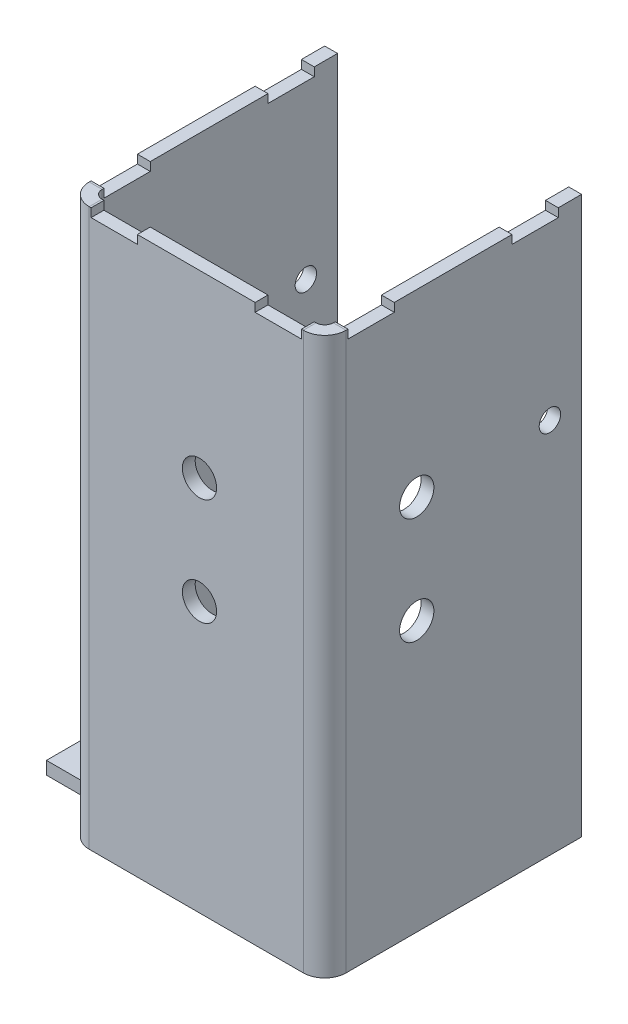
ISO-10303-21;
HEADER;
FILE_DESCRIPTION(('STEP AP214'),'2;1');
FILE_NAME('part.step','',(''),(''),'','','');
FILE_SCHEMA(('AUTOMOTIVE_DESIGN { 1 0 10303 214 1 1 1 1 }'));
ENDSEC;
DATA;
#1=APPLICATION_CONTEXT('core data for automotive mechanical design processes');
#2=APPLICATION_PROTOCOL_DEFINITION('international standard','automotive_design',2000,#1);
#3=PRODUCT_CONTEXT('',#1,'mechanical');
#4=PRODUCT('Part','Part','',(#3));
#5=PRODUCT_RELATED_PRODUCT_CATEGORY('part','',(#4));
#6=PRODUCT_DEFINITION_FORMATION('','',#4);
#7=PRODUCT_DEFINITION_CONTEXT('part definition',#1,'design');
#8=PRODUCT_DEFINITION('design','',#6,#7);
#9=PRODUCT_DEFINITION_SHAPE('','',#8);
#10=(LENGTH_UNIT() NAMED_UNIT(*) SI_UNIT(.MILLI.,.METRE.));
#11=(NAMED_UNIT(*) PLANE_ANGLE_UNIT() SI_UNIT($,.RADIAN.));
#12=(NAMED_UNIT(*) SI_UNIT($,.STERADIAN.) SOLID_ANGLE_UNIT());
#13=UNCERTAINTY_MEASURE_WITH_UNIT(LENGTH_MEASURE(1.E-05),#10,'distance_accuracy_value','');
#14=(GEOMETRIC_REPRESENTATION_CONTEXT(3) GLOBAL_UNCERTAINTY_ASSIGNED_CONTEXT((#13)) GLOBAL_UNIT_ASSIGNED_CONTEXT((#10,
#11,#12)) REPRESENTATION_CONTEXT('',''));
#15=CARTESIAN_POINT('',(0.,0.,0.));
#16=DIRECTION('',(0.,0.,1.));
#17=DIRECTION('',(1.,0.,0.));
#18=AXIS2_PLACEMENT_3D('',#15,#16,#17);
#19=CARTESIAN_POINT('',(2.99999999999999,130.,0.));
#20=DIRECTION('',(0.,-1.,0.));
#21=DIRECTION('',(0.,0.,-1.));
#22=AXIS2_PLACEMENT_3D('',#19,#20,#21);
#23=PLANE('',#22);
#24=DIRECTION('',(0.,0.,1.));
#25=VECTOR('',#24,1.);
#26=CARTESIAN_POINT('',(43.7477270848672,130.,1.42247325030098E-13));
#27=LINE('',#26,#25);
#28=CARTESIAN_POINT('',(43.7477270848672,130.,1.42247325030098E-13));
#29=VERTEX_POINT('',#28);
#30=CARTESIAN_POINT('',(43.7477270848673,130.,-2.99999999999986));
#31=VERTEX_POINT('',#30);
#32=EDGE_CURVE('E412',#29,#31,#27,.F.);
#33=ORIENTED_EDGE('',*,*,#32,.T.);
#34=DIRECTION('',(1.,0.,0.));
#35=VECTOR('',#34,1.);
#36=CARTESIAN_POINT('',(3.,130.,-3.));
#37=LINE('',#36,#35);
#38=CARTESIAN_POINT('',(16.2522729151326,130.,-2.99999999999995));
#39=VERTEX_POINT('',#38);
#40=EDGE_CURVE('E648',#31,#39,#37,.F.);
#41=ORIENTED_EDGE('',*,*,#40,.T.);
#42=DIRECTION('',(0.,0.,1.));
#43=VECTOR('',#42,1.);
#44=CARTESIAN_POINT('',(16.2522729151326,130.,0.));
#45=LINE('',#44,#43);
#46=CARTESIAN_POINT('',(16.2522729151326,130.,0.));
#47=VERTEX_POINT('',#46);
#48=EDGE_CURVE('E535',#47,#39,#45,.F.);
#49=ORIENTED_EDGE('',*,*,#48,.F.);
#50=DIRECTION('',(-1.,0.,0.));
#51=VECTOR('',#50,1.);
#52=CARTESIAN_POINT('',(60.,130.,1.99059518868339E-13));
#53=LINE('',#52,#51);
#54=EDGE_CURVE('E640',#29,#47,#53,.T.);
#55=ORIENTED_EDGE('',*,*,#54,.F.);
#56=EDGE_LOOP('',(#33,#41,#49,#55));
#57=FACE_BOUND('',#56,.T.);
#58=ADVANCED_FACE('F96',(#57),#23,.F.);
#59=DIRECTION('',(0.,0.,-1.));
#60=VECTOR('',#59,1.);
#61=CARTESIAN_POINT('',(54.5611481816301,130.,-2.99999999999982));
#62=LINE('',#61,#60);
#63=CARTESIAN_POINT('',(54.5611481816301,130.,-2.99999999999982));
#64=VERTEX_POINT('',#63);
#65=CARTESIAN_POINT('',(54.5611481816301,130.,1.80069858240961E-13));
#66=VERTEX_POINT('',#65);
#67=EDGE_CURVE('E113',#64,#66,#62,.F.);
#68=ORIENTED_EDGE('',*,*,#67,.T.);
#69=CARTESIAN_POINT('',(55.,130.,1.89518539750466E-13));
#70=VERTEX_POINT('',#69);
#71=EDGE_CURVE('E401',#70,#66,#53,.T.);
#72=ORIENTED_EDGE('',*,*,#71,.F.);
#73=DIRECTION('',(0.,0.,1.));
#74=VECTOR('',#73,1.);
#75=CARTESIAN_POINT('',(55.,130.,-2.99999999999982));
#76=LINE('',#75,#74);
#77=CARTESIAN_POINT('',(55.,130.,-2.99999999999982));
#78=VERTEX_POINT('',#77);
#79=EDGE_CURVE('E630',#78,#70,#76,.T.);
#80=ORIENTED_EDGE('',*,*,#79,.F.);
#81=EDGE_CURVE('E645',#78,#64,#37,.F.);
#82=ORIENTED_EDGE('',*,*,#81,.T.);
#83=EDGE_LOOP('',(#68,#72,#80,#82));
#84=FACE_BOUND('',#83,.T.);
#85=ADVANCED_FACE('F852',(#84),#23,.F.);
#86=CARTESIAN_POINT('',(60.,130.,1.99059518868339E-13));
#87=DIRECTION('',(0.,0.,-1.));
#88=DIRECTION('',(-1.,0.,0.));
#89=AXIS2_PLACEMENT_3D('',#86,#87,#88);
#90=PLANE('',#89);
#91=CARTESIAN_POINT('',(30.75,63.,0.));
#92=DIRECTION('',(0.,0.,1.));
#93=DIRECTION('',(1.,0.,0.));
#94=AXIS2_PLACEMENT_3D('',#91,#92,#93);
#95=CIRCLE('',#94,4.);
#96=CARTESIAN_POINT('',(34.75,63.,0.));
#97=VERTEX_POINT('',#96);
#98=EDGE_CURVE('E950',#97,#97,#95,.T.);
#99=ORIENTED_EDGE('',*,*,#98,.F.);
#100=EDGE_LOOP('',(#99));
#101=FACE_BOUND('',#100,.T.);
#102=CARTESIAN_POINT('',(30.75,88.,0.));
#103=DIRECTION('',(0.,0.,1.));
#104=DIRECTION('',(1.,0.,0.));
#105=AXIS2_PLACEMENT_3D('',#102,#103,#104);
#106=CIRCLE('',#105,4.);
#107=CARTESIAN_POINT('',(34.75,88.,0.));
#108=VERTEX_POINT('',#107);
#109=EDGE_CURVE('E406',#108,#108,#106,.T.);
#110=ORIENTED_EDGE('',*,*,#109,.F.);
#111=EDGE_LOOP('',(#110));
#112=FACE_BOUND('',#111,.T.);
#113=DIRECTION('',(0.,1.,0.));
#114=VECTOR('',#113,1.);
#115=CARTESIAN_POINT('',(43.7477270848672,128.,1.41675028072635E-13));
#116=LINE('',#115,#114);
#117=CARTESIAN_POINT('',(43.7477270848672,128.,1.42247325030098E-13));
#118=VERTEX_POINT('',#117);
#119=EDGE_CURVE('E392',#29,#118,#116,.F.);
#120=ORIENTED_EDGE('',*,*,#119,.F.);
#121=ORIENTED_EDGE('',*,*,#54,.T.);
#122=DIRECTION('',(0.,1.,0.));
#123=VECTOR('',#122,1.);
#124=CARTESIAN_POINT('',(16.2522729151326,128.,0.));
#125=LINE('',#124,#123);
#126=CARTESIAN_POINT('',(16.2522729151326,128.,0.));
#127=VERTEX_POINT('',#126);
#128=EDGE_CURVE('E539',#127,#47,#125,.T.);
#129=ORIENTED_EDGE('',*,*,#128,.F.);
#130=DIRECTION('',(1.,0.,0.));
#131=VECTOR('',#130,1.);
#132=CARTESIAN_POINT('',(60.,128.,1.99059518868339E-13));
#133=LINE('',#132,#131);
#134=CARTESIAN_POINT('',(5.4388518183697,128.,0.));
#135=VERTEX_POINT('',#134);
#136=EDGE_CURVE('E529',#135,#127,#133,.T.);
#137=ORIENTED_EDGE('',*,*,#136,.F.);
#138=DIRECTION('',(0.,1.,0.));
#139=VECTOR('',#138,1.);
#140=CARTESIAN_POINT('',(5.4388518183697,130.,0.));
#141=LINE('',#140,#139);
#142=CARTESIAN_POINT('',(5.4388518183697,130.,0.));
#143=VERTEX_POINT('',#142);
#144=EDGE_CURVE('E522',#135,#143,#141,.T.);
#145=ORIENTED_EDGE('',*,*,#144,.T.);
#146=CARTESIAN_POINT('',(4.99999999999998,130.,0.));
#147=VERTEX_POINT('',#146);
#148=EDGE_CURVE('E641',#143,#147,#53,.T.);
#149=ORIENTED_EDGE('',*,*,#148,.T.);
#150=DIRECTION('',(0.,-1.,0.));
#151=VECTOR('',#150,1.);
#152=CARTESIAN_POINT('',(4.99999999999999,130.,0.));
#153=LINE('',#152,#151);
#154=CARTESIAN_POINT('',(4.99999999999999,0.,0.));
#155=VERTEX_POINT('',#154);
#156=EDGE_CURVE('E650',#155,#147,#153,.F.);
#157=ORIENTED_EDGE('',*,*,#156,.F.);
#158=DIRECTION('',(1.,0.,0.));
#159=VECTOR('',#158,1.);
#160=CARTESIAN_POINT('',(60.,0.,1.99059518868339E-13));
#161=LINE('',#160,#159);
#162=CARTESIAN_POINT('',(55.,0.,1.8474805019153E-13));
#163=VERTEX_POINT('',#162);
#164=EDGE_CURVE('E636',#155,#163,#161,.T.);
#165=ORIENTED_EDGE('',*,*,#164,.T.);
#166=DIRECTION('',(0.,-1.,0.));
#167=VECTOR('',#166,1.);
#168=CARTESIAN_POINT('',(55.,0.,1.8474805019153E-13));
#169=LINE('',#168,#167);
#170=EDGE_CURVE('E613',#163,#70,#169,.F.);
#171=ORIENTED_EDGE('',*,*,#170,.T.);
#172=ORIENTED_EDGE('',*,*,#71,.T.);
#173=DIRECTION('',(0.,1.,0.));
#174=VECTOR('',#173,1.);
#175=CARTESIAN_POINT('',(54.5611481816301,130.,1.80069858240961E-13));
#176=LINE('',#175,#174);
#177=CARTESIAN_POINT('',(54.5611481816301,128.,1.80069858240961E-13));
#178=VERTEX_POINT('',#177);
#179=EDGE_CURVE('E395',#66,#178,#176,.F.);
#180=ORIENTED_EDGE('',*,*,#179,.T.);
#181=DIRECTION('',(1.,0.,0.));
#182=VECTOR('',#181,1.);
#183=CARTESIAN_POINT('',(60.,128.,1.99059518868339E-13));
#184=LINE('',#183,#182);
#185=EDGE_CURVE('E382',#118,#178,#184,.T.);
#186=ORIENTED_EDGE('',*,*,#185,.F.);
#187=EDGE_LOOP('',(#120,#121,#129,#137,#145,#149,#157,#165,#171,#172,#180,#186));
#188=FACE_BOUND('',#187,.T.);
#189=ADVANCED_FACE('F399',(#101,#112,#188),#90,.F.);
#190=CARTESIAN_POINT('',(60.,130.,-2.9999999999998));
#191=DIRECTION('',(0.,0.,-1.));
#192=DIRECTION('',(-1.,0.,0.));
#193=AXIS2_PLACEMENT_3D('',#190,#191,#192);
#194=PLANE('',#193);
#195=CARTESIAN_POINT('',(30.75,63.,-3.));
#196=DIRECTION('',(0.,0.,1.));
#197=DIRECTION('',(1.,0.,0.));
#198=AXIS2_PLACEMENT_3D('',#195,#196,#197);
#199=CIRCLE('',#198,4.);
#200=CARTESIAN_POINT('',(34.75,63.,-3.));
#201=VERTEX_POINT('',#200);
#202=EDGE_CURVE('E947',#201,#201,#199,.T.);
#203=ORIENTED_EDGE('',*,*,#202,.T.);
#204=EDGE_LOOP('',(#203));
#205=FACE_BOUND('',#204,.T.);
#206=CARTESIAN_POINT('',(30.75,88.,-3.));
#207=DIRECTION('',(0.,0.,1.));
#208=DIRECTION('',(1.,0.,0.));
#209=AXIS2_PLACEMENT_3D('',#206,#207,#208);
#210=CIRCLE('',#209,4.);
#211=CARTESIAN_POINT('',(34.75,88.,-3.));
#212=VERTEX_POINT('',#211);
#213=EDGE_CURVE('E403',#212,#212,#210,.T.);
#214=ORIENTED_EDGE('',*,*,#213,.T.);
#215=EDGE_LOOP('',(#214));
#216=FACE_BOUND('',#215,.T.);
#217=ORIENTED_EDGE('',*,*,#40,.F.);
#218=DIRECTION('',(0.,1.,0.));
#219=VECTOR('',#218,1.);
#220=CARTESIAN_POINT('',(43.7477270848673,130.,-2.99999999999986));
#221=LINE('',#220,#219);
#222=CARTESIAN_POINT('',(43.7477270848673,128.,-2.99999999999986));
#223=VERTEX_POINT('',#222);
#224=EDGE_CURVE('E391',#31,#223,#221,.F.);
#225=ORIENTED_EDGE('',*,*,#224,.T.);
#226=DIRECTION('',(-1.,0.,0.));
#227=VECTOR('',#226,1.);
#228=CARTESIAN_POINT('',(60.,128.,-2.9999999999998));
#229=LINE('',#228,#227);
#230=CARTESIAN_POINT('',(54.5611481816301,128.,-2.99999999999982));
#231=VERTEX_POINT('',#230);
#232=EDGE_CURVE('E410',#223,#231,#229,.F.);
#233=ORIENTED_EDGE('',*,*,#232,.T.);
#234=DIRECTION('',(0.,1.,0.));
#235=VECTOR('',#234,1.);
#236=CARTESIAN_POINT('',(54.5611481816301,128.,-2.99999999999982));
#237=LINE('',#236,#235);
#238=EDGE_CURVE('E396',#64,#231,#237,.F.);
#239=ORIENTED_EDGE('',*,*,#238,.F.);
#240=ORIENTED_EDGE('',*,*,#81,.F.);
#241=DIRECTION('',(0.,-1.,0.));
#242=VECTOR('',#241,1.);
#243=CARTESIAN_POINT('',(55.,0.,-2.99999999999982));
#244=LINE('',#243,#242);
#245=CARTESIAN_POINT('',(55.,0.,-2.99999999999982));
#246=VERTEX_POINT('',#245);
#247=EDGE_CURVE('E625',#246,#78,#244,.F.);
#248=ORIENTED_EDGE('',*,*,#247,.F.);
#249=DIRECTION('',(-1.,0.,0.));
#250=VECTOR('',#249,1.);
#251=CARTESIAN_POINT('',(60.,0.,-2.9999999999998));
#252=LINE('',#251,#250);
#253=CARTESIAN_POINT('',(4.99999999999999,0.,-2.99999999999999));
#254=VERTEX_POINT('',#253);
#255=EDGE_CURVE('E642',#254,#246,#252,.F.);
#256=ORIENTED_EDGE('',*,*,#255,.F.);
#257=DIRECTION('',(0.,-1.,0.));
#258=VECTOR('',#257,1.);
#259=CARTESIAN_POINT('',(4.99999999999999,130.,-2.99999999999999));
#260=LINE('',#259,#258);
#261=CARTESIAN_POINT('',(4.99999999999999,130.,-2.99999999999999));
#262=VERTEX_POINT('',#261);
#263=EDGE_CURVE('E656',#262,#254,#260,.T.);
#264=ORIENTED_EDGE('',*,*,#263,.F.);
#265=CARTESIAN_POINT('',(5.43885181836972,130.,-2.99999999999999));
#266=VERTEX_POINT('',#265);
#267=EDGE_CURVE('E649',#266,#262,#37,.F.);
#268=ORIENTED_EDGE('',*,*,#267,.F.);
#269=DIRECTION('',(0.,1.,0.));
#270=VECTOR('',#269,1.);
#271=CARTESIAN_POINT('',(5.43885181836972,128.,-2.99999999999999));
#272=LINE('',#271,#270);
#273=CARTESIAN_POINT('',(5.43885181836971,128.,-2.99999999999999));
#274=VERTEX_POINT('',#273);
#275=EDGE_CURVE('E520',#274,#266,#272,.T.);
#276=ORIENTED_EDGE('',*,*,#275,.F.);
#277=DIRECTION('',(-1.,0.,0.));
#278=VECTOR('',#277,1.);
#279=CARTESIAN_POINT('',(60.,128.,-2.9999999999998));
#280=LINE('',#279,#278);
#281=CARTESIAN_POINT('',(16.2522729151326,128.,-2.99999999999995));
#282=VERTEX_POINT('',#281);
#283=EDGE_CURVE('E536',#274,#282,#280,.F.);
#284=ORIENTED_EDGE('',*,*,#283,.T.);
#285=DIRECTION('',(0.,1.,0.));
#286=VECTOR('',#285,1.);
#287=CARTESIAN_POINT('',(16.2522729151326,130.,-2.99999999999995));
#288=LINE('',#287,#286);
#289=EDGE_CURVE('E532',#282,#39,#288,.T.);
#290=ORIENTED_EDGE('',*,*,#289,.T.);
#291=EDGE_LOOP('',(#217,#225,#233,#239,#240,#248,#256,#264,#268,#276,#284,#290));
#292=FACE_BOUND('',#291,.T.);
#293=ADVANCED_FACE('F795',(#205,#216,#292),#194,.T.);
#294=CARTESIAN_POINT('',(60.,0.,-2.99999999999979));
#295=DIRECTION('',(-1.,0.,0.));
#296=DIRECTION('',(0.,0.,1.));
#297=AXIS2_PLACEMENT_3D('',#294,#295,#296);
#298=PLANE('',#297);
#299=CARTESIAN_POINT('',(60.0000000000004,63.,-21.5));
#300=DIRECTION('',(1.,0.,0.));
#301=DIRECTION('',(0.,0.,-1.));
#302=AXIS2_PLACEMENT_3D('',#299,#300,#301);
#303=CIRCLE('',#302,4.);
#304=CARTESIAN_POINT('',(60.0000000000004,63.,-25.5));
#305=VERTEX_POINT('',#304);
#306=EDGE_CURVE('E558',#305,#305,#303,.T.);
#307=ORIENTED_EDGE('',*,*,#306,.F.);
#308=EDGE_LOOP('',(#307));
#309=FACE_BOUND('',#308,.T.);
#310=CARTESIAN_POINT('',(60.0000000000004,88.,-21.5));
#311=DIRECTION('',(1.,0.,0.));
#312=DIRECTION('',(0.,0.,-1.));
#313=AXIS2_PLACEMENT_3D('',#310,#311,#312);
#314=CIRCLE('',#313,4.);
#315=CARTESIAN_POINT('',(60.0000000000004,88.,-25.5));
#316=VERTEX_POINT('',#315);
#317=EDGE_CURVE('E568',#316,#316,#314,.T.);
#318=ORIENTED_EDGE('',*,*,#317,.F.);
#319=EDGE_LOOP('',(#318));
#320=FACE_BOUND('',#319,.T.);
#321=CARTESIAN_POINT('',(60.0000000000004,88.,-52.6));
#322=DIRECTION('',(1.,0.,0.));
#323=DIRECTION('',(0.,0.,-1.));
#324=AXIS2_PLACEMENT_3D('',#321,#322,#323);
#325=CIRCLE('',#324,2.5);
#326=CARTESIAN_POINT('',(60.0000000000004,88.,-55.1));
#327=VERTEX_POINT('',#326);
#328=EDGE_CURVE('E549',#327,#327,#325,.T.);
#329=ORIENTED_EDGE('',*,*,#328,.F.);
#330=EDGE_LOOP('',(#329));
#331=FACE_BOUND('',#330,.T.);
#332=DIRECTION('',(0.,1.,0.));
#333=VECTOR('',#332,1.);
#334=CARTESIAN_POINT('',(60.0000000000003,128.,-43.7477270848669));
#335=LINE('',#334,#333);
#336=CARTESIAN_POINT('',(60.0000000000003,130.,-43.7477270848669));
#337=VERTEX_POINT('',#336);
#338=CARTESIAN_POINT('',(60.0000000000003,128.,-43.7477270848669));
#339=VERTEX_POINT('',#338);
#340=EDGE_CURVE('E426',#337,#339,#335,.F.);
#341=ORIENTED_EDGE('',*,*,#340,.F.);
#342=DIRECTION('',(0.,0.,1.));
#343=VECTOR('',#342,1.);
#344=CARTESIAN_POINT('',(60.,130.,-2.99999999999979));
#345=LINE('',#344,#343);
#346=CARTESIAN_POINT('',(60.0000000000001,130.,-16.2522729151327));
#347=VERTEX_POINT('',#346);
#348=EDGE_CURVE('E588',#337,#347,#345,.T.);
#349=ORIENTED_EDGE('',*,*,#348,.T.);
#350=DIRECTION('',(0.,1.,0.));
#351=VECTOR('',#350,1.);
#352=CARTESIAN_POINT('',(60.0000000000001,128.,-16.2522729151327));
#353=LINE('',#352,#351);
#354=CARTESIAN_POINT('',(60.0000000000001,128.,-16.2522729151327));
#355=VERTEX_POINT('',#354);
#356=EDGE_CURVE('E457',#355,#347,#353,.T.);
#357=ORIENTED_EDGE('',*,*,#356,.F.);
#358=DIRECTION('',(0.,0.,-1.));
#359=VECTOR('',#358,1.);
#360=CARTESIAN_POINT('',(60.,128.,-2.99999999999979));
#361=LINE('',#360,#359);
#362=CARTESIAN_POINT('',(60.,128.,-5.43885181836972));
#363=VERTEX_POINT('',#362);
#364=EDGE_CURVE('E452',#363,#355,#361,.T.);
#365=ORIENTED_EDGE('',*,*,#364,.F.);
#366=DIRECTION('',(0.,1.,0.));
#367=VECTOR('',#366,1.);
#368=CARTESIAN_POINT('',(60.,0.,-5.43885181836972));
#369=LINE('',#368,#367);
#370=CARTESIAN_POINT('',(60.,130.,-5.43885181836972));
#371=VERTEX_POINT('',#370);
#372=EDGE_CURVE('E443',#363,#371,#369,.T.);
#373=ORIENTED_EDGE('',*,*,#372,.T.);
#374=CARTESIAN_POINT('',(60.,130.,-4.99999999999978));
#375=VERTEX_POINT('',#374);
#376=EDGE_CURVE('E589',#371,#375,#345,.T.);
#377=ORIENTED_EDGE('',*,*,#376,.T.);
#378=DIRECTION('',(0.,-1.,0.));
#379=VECTOR('',#378,1.);
#380=CARTESIAN_POINT('',(60.,130.,-4.99999999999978));
#381=LINE('',#380,#379);
#382=CARTESIAN_POINT('',(60.,0.,-4.99999999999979));
#383=VERTEX_POINT('',#382);
#384=EDGE_CURVE('E603',#383,#375,#381,.F.);
#385=ORIENTED_EDGE('',*,*,#384,.F.);
#386=DIRECTION('',(0.,0.,-1.));
#387=VECTOR('',#386,1.);
#388=CARTESIAN_POINT('',(60.,0.,-2.99999999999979));
#389=LINE('',#388,#387);
#390=CARTESIAN_POINT('',(60.0000000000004,0.,-59.9999999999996));
#391=VERTEX_POINT('',#390);
#392=EDGE_CURVE('E592',#383,#391,#389,.T.);
#393=ORIENTED_EDGE('',*,*,#392,.T.);
#394=DIRECTION('',(0.,1.,0.));
#395=VECTOR('',#394,1.);
#396=CARTESIAN_POINT('',(60.0000000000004,0.,-59.9999999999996));
#397=LINE('',#396,#395);
#398=CARTESIAN_POINT('',(60.0000000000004,130.,-59.9999999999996));
#399=VERTEX_POINT('',#398);
#400=EDGE_CURVE('E590',#391,#399,#397,.T.);
#401=ORIENTED_EDGE('',*,*,#400,.T.);
#402=CARTESIAN_POINT('',(60.0000000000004,130.,-54.5611481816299));
#403=VERTEX_POINT('',#402);
#404=EDGE_CURVE('E585',#399,#403,#345,.T.);
#405=ORIENTED_EDGE('',*,*,#404,.T.);
#406=DIRECTION('',(0.,1.,0.));
#407=VECTOR('',#406,1.);
#408=CARTESIAN_POINT('',(60.0000000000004,0.,-54.5611481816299));
#409=LINE('',#408,#407);
#410=CARTESIAN_POINT('',(60.0000000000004,128.,-54.5611481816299));
#411=VERTEX_POINT('',#410);
#412=EDGE_CURVE('E121',#403,#411,#409,.F.);
#413=ORIENTED_EDGE('',*,*,#412,.T.);
#414=DIRECTION('',(0.,0.,-1.));
#415=VECTOR('',#414,1.);
#416=CARTESIAN_POINT('',(60.,128.,-2.99999999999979));
#417=LINE('',#416,#415);
#418=EDGE_CURVE('E434',#339,#411,#417,.T.);
#419=ORIENTED_EDGE('',*,*,#418,.F.);
#420=EDGE_LOOP('',(#341,#349,#357,#365,#373,#377,#385,#393,#401,#405,#413,#419));
#421=FACE_BOUND('',#420,.T.);
#422=ADVANCED_FACE('F792',(#309,#320,#331,#421),#298,.F.);
#423=CARTESIAN_POINT('',(57.,0.,-2.99999999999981));
#424=DIRECTION('',(-1.,0.,0.));
#425=DIRECTION('',(0.,0.,1.));
#426=AXIS2_PLACEMENT_3D('',#423,#424,#425);
#427=PLANE('',#426);
#428=CARTESIAN_POINT('',(57.0000000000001,63.,-21.5));
#429=DIRECTION('',(-1.,0.,0.));
#430=DIRECTION('',(0.,0.,1.));
#431=AXIS2_PLACEMENT_3D('',#428,#429,#430);
#432=CIRCLE('',#431,4.);
#433=CARTESIAN_POINT('',(57.0000000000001,63.,-17.5));
#434=VERTEX_POINT('',#433);
#435=EDGE_CURVE('E561',#434,#434,#432,.F.);
#436=ORIENTED_EDGE('',*,*,#435,.T.);
#437=EDGE_LOOP('',(#436));
#438=FACE_BOUND('',#437,.T.);
#439=CARTESIAN_POINT('',(57.0000000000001,88.,-21.5));
#440=DIRECTION('',(-1.,0.,0.));
#441=DIRECTION('',(0.,0.,1.));
#442=AXIS2_PLACEMENT_3D('',#439,#440,#441);
#443=CIRCLE('',#442,4.);
#444=CARTESIAN_POINT('',(57.0000000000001,88.,-17.5));
#445=VERTEX_POINT('',#444);
#446=EDGE_CURVE('E571',#445,#445,#443,.F.);
#447=ORIENTED_EDGE('',*,*,#446,.T.);
#448=EDGE_LOOP('',(#447));
#449=FACE_BOUND('',#448,.T.);
#450=CARTESIAN_POINT('',(57.0000000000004,88.,-52.6));
#451=DIRECTION('',(-1.,0.,0.));
#452=DIRECTION('',(0.,0.,1.));
#453=AXIS2_PLACEMENT_3D('',#450,#451,#452);
#454=CIRCLE('',#453,2.5);
#455=CARTESIAN_POINT('',(57.0000000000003,88.,-50.1));
#456=VERTEX_POINT('',#455);
#457=EDGE_CURVE('E100',#456,#456,#454,.F.);
#458=ORIENTED_EDGE('',*,*,#457,.T.);
#459=EDGE_LOOP('',(#458));
#460=FACE_BOUND('',#459,.T.);
#461=DIRECTION('',(0.,0.,-1.));
#462=VECTOR('',#461,1.);
#463=CARTESIAN_POINT('',(57.,130.,-2.99999999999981));
#464=LINE('',#463,#462);
#465=CARTESIAN_POINT('',(57.0000000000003,130.,-43.7477270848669));
#466=VERTEX_POINT('',#465);
#467=CARTESIAN_POINT('',(57.0000000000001,130.,-16.2522729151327));
#468=VERTEX_POINT('',#467);
#469=EDGE_CURVE('E597',#466,#468,#464,.F.);
#470=ORIENTED_EDGE('',*,*,#469,.F.);
#471=DIRECTION('',(0.,1.,0.));
#472=VECTOR('',#471,1.);
#473=CARTESIAN_POINT('',(57.0000000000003,0.,-43.7477270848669));
#474=LINE('',#473,#472);
#475=CARTESIAN_POINT('',(57.0000000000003,128.,-43.7477270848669));
#476=VERTEX_POINT('',#475);
#477=EDGE_CURVE('E431',#466,#476,#474,.F.);
#478=ORIENTED_EDGE('',*,*,#477,.T.);
#479=DIRECTION('',(0.,0.,1.));
#480=VECTOR('',#479,1.);
#481=CARTESIAN_POINT('',(57.,128.,-2.99999999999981));
#482=LINE('',#481,#480);
#483=CARTESIAN_POINT('',(57.0000000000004,128.,-54.5611481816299));
#484=VERTEX_POINT('',#483);
#485=EDGE_CURVE('E428',#476,#484,#482,.F.);
#486=ORIENTED_EDGE('',*,*,#485,.T.);
#487=DIRECTION('',(0.,1.,0.));
#488=VECTOR('',#487,1.);
#489=CARTESIAN_POINT('',(57.0000000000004,128.,-54.5611481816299));
#490=LINE('',#489,#488);
#491=CARTESIAN_POINT('',(57.0000000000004,130.,-54.5611481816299));
#492=VERTEX_POINT('',#491);
#493=EDGE_CURVE('E417',#492,#484,#490,.F.);
#494=ORIENTED_EDGE('',*,*,#493,.F.);
#495=CARTESIAN_POINT('',(57.0000000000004,130.,-59.9999999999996));
#496=VERTEX_POINT('',#495);
#497=EDGE_CURVE('E594',#496,#492,#464,.F.);
#498=ORIENTED_EDGE('',*,*,#497,.F.);
#499=DIRECTION('',(0.,-1.,0.));
#500=VECTOR('',#499,1.);
#501=CARTESIAN_POINT('',(57.0000000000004,130.,-59.9999999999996));
#502=LINE('',#501,#500);
#503=CARTESIAN_POINT('',(57.0000000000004,0.,-59.9999999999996));
#504=VERTEX_POINT('',#503);
#505=EDGE_CURVE('E599',#504,#496,#502,.F.);
#506=ORIENTED_EDGE('',*,*,#505,.F.);
#507=DIRECTION('',(0.,0.,1.));
#508=VECTOR('',#507,1.);
#509=CARTESIAN_POINT('',(57.0000000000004,0.,-59.9999999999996));
#510=LINE('',#509,#508);
#511=CARTESIAN_POINT('',(57.,0.,-4.9999999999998));
#512=VERTEX_POINT('',#511);
#513=EDGE_CURVE('E601',#512,#504,#510,.F.);
#514=ORIENTED_EDGE('',*,*,#513,.F.);
#515=DIRECTION('',(0.,-1.,0.));
#516=VECTOR('',#515,1.);
#517=CARTESIAN_POINT('',(57.,130.,-4.9999999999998));
#518=LINE('',#517,#516);
#519=CARTESIAN_POINT('',(57.,130.,-4.9999999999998));
#520=VERTEX_POINT('',#519);
#521=EDGE_CURVE('E609',#520,#512,#518,.T.);
#522=ORIENTED_EDGE('',*,*,#521,.F.);
#523=CARTESIAN_POINT('',(57.,130.,-5.43885181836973));
#524=VERTEX_POINT('',#523);
#525=EDGE_CURVE('E598',#524,#520,#464,.F.);
#526=ORIENTED_EDGE('',*,*,#525,.F.);
#527=DIRECTION('',(0.,1.,0.));
#528=VECTOR('',#527,1.);
#529=CARTESIAN_POINT('',(57.,128.,-5.43885181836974));
#530=LINE('',#529,#528);
#531=CARTESIAN_POINT('',(57.,128.,-5.43885181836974));
#532=VERTEX_POINT('',#531);
#533=EDGE_CURVE('E442',#532,#524,#530,.T.);
#534=ORIENTED_EDGE('',*,*,#533,.F.);
#535=DIRECTION('',(0.,0.,1.));
#536=VECTOR('',#535,1.);
#537=CARTESIAN_POINT('',(57.,128.,-2.99999999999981));
#538=LINE('',#537,#536);
#539=CARTESIAN_POINT('',(57.0000000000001,128.,-16.2522729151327));
#540=VERTEX_POINT('',#539);
#541=EDGE_CURVE('E453',#532,#540,#538,.F.);
#542=ORIENTED_EDGE('',*,*,#541,.T.);
#543=DIRECTION('',(0.,1.,0.));
#544=VECTOR('',#543,1.);
#545=CARTESIAN_POINT('',(57.0000000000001,0.,-16.2522729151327));
#546=LINE('',#545,#544);
#547=EDGE_CURVE('E456',#540,#468,#546,.T.);
#548=ORIENTED_EDGE('',*,*,#547,.T.);
#549=EDGE_LOOP('',(#470,#478,#486,#494,#498,#506,#514,#522,#526,#534,#542,#548));
#550=FACE_BOUND('',#549,.T.);
#551=ADVANCED_FACE('F781',(#438,#449,#460,#550),#427,.T.);
#552=CARTESIAN_POINT('',(60.,130.,-2.99999999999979));
#553=DIRECTION('',(0.,-1.,0.));
#554=DIRECTION('',(0.,0.,-1.));
#555=AXIS2_PLACEMENT_3D('',#552,#553,#554);
#556=PLANE('',#555);
#557=DIRECTION('',(1.,0.,0.));
#558=VECTOR('',#557,1.);
#559=CARTESIAN_POINT('',(60.0000000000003,130.,-43.7477270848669));
#560=LINE('',#559,#558);
#561=EDGE_CURVE('E439',#337,#466,#560,.F.);
#562=ORIENTED_EDGE('',*,*,#561,.T.);
#563=ORIENTED_EDGE('',*,*,#469,.T.);
#564=DIRECTION('',(1.,0.,0.));
#565=VECTOR('',#564,1.);
#566=CARTESIAN_POINT('',(60.0000000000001,130.,-16.2522729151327));
#567=LINE('',#566,#565);
#568=EDGE_CURVE('E464',#347,#468,#567,.F.);
#569=ORIENTED_EDGE('',*,*,#568,.F.);
#570=ORIENTED_EDGE('',*,*,#348,.F.);
#571=EDGE_LOOP('',(#562,#563,#569,#570));
#572=FACE_BOUND('',#571,.T.);
#573=ADVANCED_FACE('F809',(#572),#556,.F.);
#574=DIRECTION('',(-1.,0.,0.));
#575=VECTOR('',#574,1.);
#576=CARTESIAN_POINT('',(57.0000000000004,130.,-54.5611481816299));
#577=LINE('',#576,#575);
#578=EDGE_CURVE('E421',#492,#403,#577,.F.);
#579=ORIENTED_EDGE('',*,*,#578,.T.);
#580=ORIENTED_EDGE('',*,*,#404,.F.);
#581=DIRECTION('',(-1.,0.,0.));
#582=VECTOR('',#581,1.);
#583=CARTESIAN_POINT('',(60.0000000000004,130.,-59.9999999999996));
#584=LINE('',#583,#582);
#585=EDGE_CURVE('E582',#399,#496,#584,.T.);
#586=ORIENTED_EDGE('',*,*,#585,.T.);
#587=ORIENTED_EDGE('',*,*,#497,.T.);
#588=EDGE_LOOP('',(#579,#580,#586,#587));
#589=FACE_BOUND('',#588,.T.);
#590=ADVANCED_FACE('F920',(#589),#556,.F.);
#591=DIRECTION('',(-1.,0.,0.));
#592=VECTOR('',#591,1.);
#593=CARTESIAN_POINT('',(57.,130.,-5.43885181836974));
#594=LINE('',#593,#592);
#595=EDGE_CURVE('E446',#524,#371,#594,.F.);
#596=ORIENTED_EDGE('',*,*,#595,.F.);
#597=ORIENTED_EDGE('',*,*,#525,.T.);
#598=DIRECTION('',(-1.,0.,0.));
#599=VECTOR('',#598,1.);
#600=CARTESIAN_POINT('',(60.,130.,-4.99999999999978));
#601=LINE('',#600,#599);
#602=EDGE_CURVE('E577',#520,#375,#601,.F.);
#603=ORIENTED_EDGE('',*,*,#602,.T.);
#604=ORIENTED_EDGE('',*,*,#376,.F.);
#605=EDGE_LOOP('',(#596,#597,#603,#604));
#606=FACE_BOUND('',#605,.T.);
#607=ADVANCED_FACE('F825',(#606),#556,.F.);
#608=CARTESIAN_POINT('',(3.,130.,-60.));
#609=DIRECTION('',(-1.,0.,0.));
#610=DIRECTION('',(0.,0.,1.));
#611=AXIS2_PLACEMENT_3D('',#608,#609,#610);
#612=PLANE('',#611);
#613=CARTESIAN_POINT('',(3.,63.,-21.5));
#614=DIRECTION('',(-1.,0.,0.));
#615=DIRECTION('',(0.,0.,1.));
#616=AXIS2_PLACEMENT_3D('',#613,#614,#615);
#617=CIRCLE('',#616,4.);
#618=CARTESIAN_POINT('',(3.,63.,-17.5));
#619=VERTEX_POINT('',#618);
#620=EDGE_CURVE('E564',#619,#619,#617,.F.);
#621=ORIENTED_EDGE('',*,*,#620,.F.);
#622=EDGE_LOOP('',(#621));
#623=FACE_BOUND('',#622,.T.);
#624=CARTESIAN_POINT('',(3.,88.,-21.5));
#625=DIRECTION('',(-1.,0.,0.));
#626=DIRECTION('',(0.,0.,1.));
#627=AXIS2_PLACEMENT_3D('',#624,#625,#626);
#628=CIRCLE('',#627,4.);
#629=CARTESIAN_POINT('',(3.,88.,-17.5));
#630=VERTEX_POINT('',#629);
#631=EDGE_CURVE('E574',#630,#630,#628,.F.);
#632=ORIENTED_EDGE('',*,*,#631,.F.);
#633=EDGE_LOOP('',(#632));
#634=FACE_BOUND('',#633,.T.);
#635=CARTESIAN_POINT('',(3.,88.,-52.6));
#636=DIRECTION('',(-1.,0.,0.));
#637=DIRECTION('',(0.,0.,1.));
#638=AXIS2_PLACEMENT_3D('',#635,#636,#637);
#639=CIRCLE('',#638,2.5);
#640=CARTESIAN_POINT('',(3.,88.,-50.1));
#641=VERTEX_POINT('',#640);
#642=EDGE_CURVE('E554',#641,#641,#639,.F.);
#643=ORIENTED_EDGE('',*,*,#642,.F.);
#644=EDGE_LOOP('',(#643));
#645=FACE_BOUND('',#644,.T.);
#646=DIRECTION('',(0.,1.,0.));
#647=VECTOR('',#646,1.);
#648=CARTESIAN_POINT('',(3.,128.,-5.43885181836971));
#649=LINE('',#648,#647);
#650=CARTESIAN_POINT('',(3.,128.,-5.43885181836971));
#651=VERTEX_POINT('',#650);
#652=CARTESIAN_POINT('',(3.,130.,-5.43885181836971));
#653=VERTEX_POINT('',#652);
#654=EDGE_CURVE('E484',#651,#653,#649,.T.);
#655=ORIENTED_EDGE('',*,*,#654,.T.);
#656=DIRECTION('',(0.,0.,1.));
#657=VECTOR('',#656,1.);
#658=CARTESIAN_POINT('',(3.,130.,0.));
#659=LINE('',#658,#657);
#660=CARTESIAN_POINT('',(2.99999999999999,130.,-4.99999999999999));
#661=VERTEX_POINT('',#660);
#662=EDGE_CURVE('E763',#653,#661,#659,.T.);
#663=ORIENTED_EDGE('',*,*,#662,.T.);
#664=DIRECTION('',(0.,-1.,0.));
#665=VECTOR('',#664,1.);
#666=CARTESIAN_POINT('',(2.99999999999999,0.,-4.99999999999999));
#667=LINE('',#666,#665);
#668=CARTESIAN_POINT('',(2.99999999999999,0.,-4.99999999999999));
#669=VERTEX_POINT('',#668);
#670=EDGE_CURVE('E673',#669,#661,#667,.F.);
#671=ORIENTED_EDGE('',*,*,#670,.F.);
#672=DIRECTION('',(0.,0.,-1.));
#673=VECTOR('',#672,1.);
#674=CARTESIAN_POINT('',(3.,0.,0.));
#675=LINE('',#674,#673);
#676=CARTESIAN_POINT('',(3.,0.,-9.55));
#677=VERTEX_POINT('',#676);
#678=EDGE_CURVE('E105',#669,#677,#675,.T.);
#679=ORIENTED_EDGE('',*,*,#678,.T.);
#680=DIRECTION('',(0.,-1.,0.));
#681=VECTOR('',#680,1.);
#682=CARTESIAN_POINT('',(3.,130.,-9.55));
#683=LINE('',#682,#681);
#684=CARTESIAN_POINT('',(3.,5.44999999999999,-9.55));
#685=VERTEX_POINT('',#684);
#686=EDGE_CURVE('E757',#685,#677,#683,.T.);
#687=ORIENTED_EDGE('',*,*,#686,.F.);
#688=CARTESIAN_POINT('',(3.,5.44999999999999,-9.775));
#689=DIRECTION('',(-1.,0.,0.));
#690=DIRECTION('',(0.,0.,1.));
#691=AXIS2_PLACEMENT_3D('',#688,#689,#690);
#692=CIRCLE('',#691,0.225);
#693=CARTESIAN_POINT('',(3.,5.44999999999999,-10.));
#694=VERTEX_POINT('',#693);
#695=EDGE_CURVE('E755',#694,#685,#692,.F.);
#696=ORIENTED_EDGE('',*,*,#695,.F.);
#697=DIRECTION('',(0.,1.,0.));
#698=VECTOR('',#697,1.);
#699=CARTESIAN_POINT('',(3.,130.,-10.));
#700=LINE('',#699,#698);
#701=CARTESIAN_POINT('',(3.,4.99999999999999,-10.));
#702=VERTEX_POINT('',#701);
#703=EDGE_CURVE('E740',#702,#694,#700,.T.);
#704=ORIENTED_EDGE('',*,*,#703,.F.);
#705=DIRECTION('',(0.,0.,1.));
#706=VECTOR('',#705,1.);
#707=CARTESIAN_POINT('',(3.,4.99999999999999,-10.));
#708=LINE('',#707,#706);
#709=CARTESIAN_POINT('',(3.,4.99999999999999,-60.));
#710=VERTEX_POINT('',#709);
#711=EDGE_CURVE('E714',#702,#710,#708,.F.);
#712=ORIENTED_EDGE('',*,*,#711,.T.);
#713=DIRECTION('',(0.,1.,0.));
#714=VECTOR('',#713,1.);
#715=CARTESIAN_POINT('',(3.,0.,-60.));
#716=LINE('',#715,#714);
#717=CARTESIAN_POINT('',(3.,130.,-60.));
#718=VERTEX_POINT('',#717);
#719=EDGE_CURVE('E761',#710,#718,#716,.T.);
#720=ORIENTED_EDGE('',*,*,#719,.T.);
#721=CARTESIAN_POINT('',(3.,130.,-54.5611481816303));
#722=VERTEX_POINT('',#721);
#723=EDGE_CURVE('E765',#718,#722,#659,.T.);
#724=ORIENTED_EDGE('',*,*,#723,.T.);
#725=DIRECTION('',(0.,1.,0.));
#726=VECTOR('',#725,1.);
#727=CARTESIAN_POINT('',(3.,128.,-54.5611481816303));
#728=LINE('',#727,#726);
#729=CARTESIAN_POINT('',(3.,128.,-54.5611481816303));
#730=VERTEX_POINT('',#729);
#731=EDGE_CURVE('E506',#722,#730,#728,.F.);
#732=ORIENTED_EDGE('',*,*,#731,.T.);
#733=DIRECTION('',(0.,0.,-1.));
#734=VECTOR('',#733,1.);
#735=CARTESIAN_POINT('',(3.,128.,-60.));
#736=LINE('',#735,#734);
#737=CARTESIAN_POINT('',(3.,128.,-43.7477270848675));
#738=VERTEX_POINT('',#737);
#739=EDGE_CURVE('E510',#738,#730,#736,.T.);
#740=ORIENTED_EDGE('',*,*,#739,.F.);
#741=DIRECTION('',(0.,1.,0.));
#742=VECTOR('',#741,1.);
#743=CARTESIAN_POINT('',(3.,130.,-43.7477270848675));
#744=LINE('',#743,#742);
#745=CARTESIAN_POINT('',(3.,130.,-43.7477270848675));
#746=VERTEX_POINT('',#745);
#747=EDGE_CURVE('E496',#746,#738,#744,.F.);
#748=ORIENTED_EDGE('',*,*,#747,.F.);
#749=CARTESIAN_POINT('',(3.,130.,-16.2522729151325));
#750=VERTEX_POINT('',#749);
#751=EDGE_CURVE('E768',#746,#750,#659,.T.);
#752=ORIENTED_EDGE('',*,*,#751,.T.);
#753=DIRECTION('',(0.,1.,0.));
#754=VECTOR('',#753,1.);
#755=CARTESIAN_POINT('',(3.,130.,-16.2522729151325));
#756=LINE('',#755,#754);
#757=CARTESIAN_POINT('',(3.,128.,-16.2522729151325));
#758=VERTEX_POINT('',#757);
#759=EDGE_CURVE('E470',#758,#750,#756,.T.);
#760=ORIENTED_EDGE('',*,*,#759,.F.);
#761=DIRECTION('',(0.,0.,-1.));
#762=VECTOR('',#761,1.);
#763=CARTESIAN_POINT('',(3.,128.,-60.));
#764=LINE('',#763,#762);
#765=EDGE_CURVE('E478',#651,#758,#764,.T.);
#766=ORIENTED_EDGE('',*,*,#765,.F.);
#767=EDGE_LOOP('',(#655,#663,#671,#679,#687,#696,#704,#712,#720,#724,#732,#740,#748,#752,#760,#766));
#768=FACE_BOUND('',#767,.T.);
#769=ADVANCED_FACE('F1233',(#623,#634,#645,#768),#612,.F.);
#770=CARTESIAN_POINT('',(0.,130.,-60.));
#771=DIRECTION('',(-1.,0.,0.));
#772=DIRECTION('',(0.,0.,1.));
#773=AXIS2_PLACEMENT_3D('',#770,#771,#772);
#774=PLANE('',#773);
#775=CARTESIAN_POINT('',(0.,63.,-21.5));
#776=DIRECTION('',(1.,0.,0.));
#777=DIRECTION('',(0.,0.,-1.));
#778=AXIS2_PLACEMENT_3D('',#775,#776,#777);
#779=CIRCLE('',#778,4.);
#780=CARTESIAN_POINT('',(0.,63.,-25.5));
#781=VERTEX_POINT('',#780);
#782=EDGE_CURVE('E557',#781,#781,#779,.T.);
#783=ORIENTED_EDGE('',*,*,#782,.T.);
#784=EDGE_LOOP('',(#783));
#785=FACE_BOUND('',#784,.T.);
#786=CARTESIAN_POINT('',(0.,88.,-21.5));
#787=DIRECTION('',(1.,0.,0.));
#788=DIRECTION('',(0.,0.,-1.));
#789=AXIS2_PLACEMENT_3D('',#786,#787,#788);
#790=CIRCLE('',#789,4.);
#791=CARTESIAN_POINT('',(0.,88.,-25.5));
#792=VERTEX_POINT('',#791);
#793=EDGE_CURVE('E567',#792,#792,#790,.T.);
#794=ORIENTED_EDGE('',*,*,#793,.T.);
#795=EDGE_LOOP('',(#794));
#796=FACE_BOUND('',#795,.T.);
#797=CARTESIAN_POINT('',(0.,88.,-52.6));
#798=DIRECTION('',(1.,0.,0.));
#799=DIRECTION('',(0.,0.,-1.));
#800=AXIS2_PLACEMENT_3D('',#797,#798,#799);
#801=CIRCLE('',#800,2.5);
#802=CARTESIAN_POINT('',(0.,88.,-55.1));
#803=VERTEX_POINT('',#802);
#804=EDGE_CURVE('E548',#803,#803,#801,.T.);
#805=ORIENTED_EDGE('',*,*,#804,.T.);
#806=EDGE_LOOP('',(#805));
#807=FACE_BOUND('',#806,.T.);
#808=DIRECTION('',(0.,0.,1.));
#809=VECTOR('',#808,1.);
#810=CARTESIAN_POINT('',(0.,130.,0.));
#811=LINE('',#810,#809);
#812=CARTESIAN_POINT('',(0.,130.,-5.43885181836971));
#813=VERTEX_POINT('',#812);
#814=CARTESIAN_POINT('',(0.,130.,-4.99999999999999));
#815=VERTEX_POINT('',#814);
#816=EDGE_CURVE('E771',#813,#815,#811,.T.);
#817=ORIENTED_EDGE('',*,*,#816,.F.);
#818=DIRECTION('',(0.,1.,0.));
#819=VECTOR('',#818,1.);
#820=CARTESIAN_POINT('',(0.,130.,-5.43885181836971));
#821=LINE('',#820,#819);
#822=CARTESIAN_POINT('',(0.,128.,-5.43885181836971));
#823=VERTEX_POINT('',#822);
#824=EDGE_CURVE('E483',#823,#813,#821,.T.);
#825=ORIENTED_EDGE('',*,*,#824,.F.);
#826=DIRECTION('',(0.,0.,1.));
#827=VECTOR('',#826,1.);
#828=CARTESIAN_POINT('',(0.,128.,-60.));
#829=LINE('',#828,#827);
#830=CARTESIAN_POINT('',(0.,128.,-16.2522729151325));
#831=VERTEX_POINT('',#830);
#832=EDGE_CURVE('E481',#823,#831,#829,.F.);
#833=ORIENTED_EDGE('',*,*,#832,.T.);
#834=DIRECTION('',(0.,1.,0.));
#835=VECTOR('',#834,1.);
#836=CARTESIAN_POINT('',(0.,128.,-16.2522729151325));
#837=LINE('',#836,#835);
#838=CARTESIAN_POINT('',(0.,130.,-16.2522729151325));
#839=VERTEX_POINT('',#838);
#840=EDGE_CURVE('E467',#831,#839,#837,.T.);
#841=ORIENTED_EDGE('',*,*,#840,.T.);
#842=CARTESIAN_POINT('',(0.,130.,-43.7477270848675));
#843=VERTEX_POINT('',#842);
#844=EDGE_CURVE('E775',#843,#839,#811,.T.);
#845=ORIENTED_EDGE('',*,*,#844,.F.);
#846=DIRECTION('',(0.,1.,0.));
#847=VECTOR('',#846,1.);
#848=CARTESIAN_POINT('',(0.,128.,-43.7477270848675));
#849=LINE('',#848,#847);
#850=CARTESIAN_POINT('',(0.,128.,-43.7477270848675));
#851=VERTEX_POINT('',#850);
#852=EDGE_CURVE('E495',#843,#851,#849,.F.);
#853=ORIENTED_EDGE('',*,*,#852,.T.);
#854=DIRECTION('',(0.,0.,1.));
#855=VECTOR('',#854,1.);
#856=CARTESIAN_POINT('',(0.,128.,-60.));
#857=LINE('',#856,#855);
#858=CARTESIAN_POINT('',(0.,128.,-54.5611481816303));
#859=VERTEX_POINT('',#858);
#860=EDGE_CURVE('E509',#851,#859,#857,.F.);
#861=ORIENTED_EDGE('',*,*,#860,.T.);
#862=DIRECTION('',(0.,1.,0.));
#863=VECTOR('',#862,1.);
#864=CARTESIAN_POINT('',(0.,130.,-54.5611481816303));
#865=LINE('',#864,#863);
#866=CARTESIAN_POINT('',(0.,130.,-54.5611481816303));
#867=VERTEX_POINT('',#866);
#868=EDGE_CURVE('E507',#867,#859,#865,.F.);
#869=ORIENTED_EDGE('',*,*,#868,.F.);
#870=CARTESIAN_POINT('',(0.,130.,-60.));
#871=VERTEX_POINT('',#870);
#872=EDGE_CURVE('E772',#871,#867,#811,.T.);
#873=ORIENTED_EDGE('',*,*,#872,.F.);
#874=DIRECTION('',(0.,1.,0.));
#875=VECTOR('',#874,1.);
#876=CARTESIAN_POINT('',(0.,0.,-60.));
#877=LINE('',#876,#875);
#878=CARTESIAN_POINT('',(0.,4.99999999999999,-60.));
#879=VERTEX_POINT('',#878);
#880=EDGE_CURVE('E760',#879,#871,#877,.T.);
#881=ORIENTED_EDGE('',*,*,#880,.F.);
#882=DIRECTION('',(0.,0.,1.));
#883=VECTOR('',#882,1.);
#884=CARTESIAN_POINT('',(0.,4.99999999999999,-10.));
#885=LINE('',#884,#883);
#886=CARTESIAN_POINT('',(0.,5.,-10.));
#887=VERTEX_POINT('',#886);
#888=EDGE_CURVE('E726',#887,#879,#885,.F.);
#889=ORIENTED_EDGE('',*,*,#888,.F.);
#890=DIRECTION('',(0.,-1.,0.));
#891=VECTOR('',#890,1.);
#892=CARTESIAN_POINT('',(0.,5.44999999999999,-10.));
#893=LINE('',#892,#891);
#894=CARTESIAN_POINT('',(0.,5.44999999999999,-10.));
#895=VERTEX_POINT('',#894);
#896=EDGE_CURVE('E746',#895,#887,#893,.T.);
#897=ORIENTED_EDGE('',*,*,#896,.F.);
#898=CARTESIAN_POINT('',(0.,5.44999999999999,-9.775));
#899=DIRECTION('',(-1.,0.,0.));
#900=DIRECTION('',(0.,0.,1.));
#901=AXIS2_PLACEMENT_3D('',#898,#899,#900);
#902=CIRCLE('',#901,0.225);
#903=CARTESIAN_POINT('',(0.,5.44999999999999,-9.55));
#904=VERTEX_POINT('',#903);
#905=EDGE_CURVE('E742',#904,#895,#902,.T.);
#906=ORIENTED_EDGE('',*,*,#905,.F.);
#907=DIRECTION('',(0.,1.,0.));
#908=VECTOR('',#907,1.);
#909=CARTESIAN_POINT('',(0.,0.,-9.55));
#910=LINE('',#909,#908);
#911=CARTESIAN_POINT('',(0.,0.,-9.55));
#912=VERTEX_POINT('',#911);
#913=EDGE_CURVE('E737',#912,#904,#910,.T.);
#914=ORIENTED_EDGE('',*,*,#913,.F.);
#915=DIRECTION('',(0.,0.,-1.));
#916=VECTOR('',#915,1.);
#917=CARTESIAN_POINT('',(0.,0.,0.));
#918=LINE('',#917,#916);
#919=CARTESIAN_POINT('',(0.,0.,-4.99999999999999));
#920=VERTEX_POINT('',#919);
#921=EDGE_CURVE('E764',#920,#912,#918,.T.);
#922=ORIENTED_EDGE('',*,*,#921,.F.);
#923=DIRECTION('',(0.,-1.,0.));
#924=VECTOR('',#923,1.);
#925=CARTESIAN_POINT('',(0.,0.,-4.99999999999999));
#926=LINE('',#925,#924);
#927=EDGE_CURVE('E660',#920,#815,#926,.F.);
#928=ORIENTED_EDGE('',*,*,#927,.T.);
#929=EDGE_LOOP('',(#817,#825,#833,#841,#845,#853,#861,#869,#873,#881,#889,#897,#906,#914,#922,#928));
#930=FACE_BOUND('',#929,.T.);
#931=ADVANCED_FACE('F1240',(#785,#796,#807,#930),#774,.T.);
#932=CARTESIAN_POINT('',(3.,130.,0.));
#933=DIRECTION('',(0.,-1.,0.));
#934=DIRECTION('',(0.,0.,-1.));
#935=AXIS2_PLACEMENT_3D('',#932,#933,#934);
#936=PLANE('',#935);
#937=DIRECTION('',(1.,0.,0.));
#938=VECTOR('',#937,1.);
#939=CARTESIAN_POINT('',(3.,130.,-5.43885181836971));
#940=LINE('',#939,#938);
#941=EDGE_CURVE('E492',#653,#813,#940,.F.);
#942=ORIENTED_EDGE('',*,*,#941,.T.);
#943=ORIENTED_EDGE('',*,*,#816,.T.);
#944=DIRECTION('',(-1.,0.,0.));
#945=VECTOR('',#944,1.);
#946=CARTESIAN_POINT('',(2.99999999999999,130.,-4.99999999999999));
#947=LINE('',#946,#945);
#948=EDGE_CURVE('E678',#661,#815,#947,.T.);
#949=ORIENTED_EDGE('',*,*,#948,.F.);
#950=ORIENTED_EDGE('',*,*,#662,.F.);
#951=EDGE_LOOP('',(#942,#943,#949,#950));
#952=FACE_BOUND('',#951,.T.);
#953=ADVANCED_FACE('F874',(#952),#936,.F.);
#954=DIRECTION('',(-1.,0.,0.));
#955=VECTOR('',#954,1.);
#956=CARTESIAN_POINT('',(0.,130.,-16.2522729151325));
#957=LINE('',#956,#955);
#958=EDGE_CURVE('E475',#839,#750,#957,.F.);
#959=ORIENTED_EDGE('',*,*,#958,.T.);
#960=ORIENTED_EDGE('',*,*,#751,.F.);
#961=DIRECTION('',(-1.,0.,0.));
#962=VECTOR('',#961,1.);
#963=CARTESIAN_POINT('',(0.,130.,-43.7477270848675));
#964=LINE('',#963,#962);
#965=EDGE_CURVE('E499',#843,#746,#964,.F.);
#966=ORIENTED_EDGE('',*,*,#965,.F.);
#967=ORIENTED_EDGE('',*,*,#844,.T.);
#968=EDGE_LOOP('',(#959,#960,#966,#967));
#969=FACE_BOUND('',#968,.T.);
#970=ADVANCED_FACE('F872',(#969),#936,.F.);
#971=DIRECTION('',(1.,0.,0.));
#972=VECTOR('',#971,1.);
#973=CARTESIAN_POINT('',(3.,130.,-54.5611481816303));
#974=LINE('',#973,#972);
#975=EDGE_CURVE('E513',#722,#867,#974,.F.);
#976=ORIENTED_EDGE('',*,*,#975,.F.);
#977=ORIENTED_EDGE('',*,*,#723,.F.);
#978=DIRECTION('',(-1.,0.,0.));
#979=VECTOR('',#978,1.);
#980=CARTESIAN_POINT('',(3.,130.,-60.));
#981=LINE('',#980,#979);
#982=EDGE_CURVE('E13',#718,#871,#981,.T.);
#983=ORIENTED_EDGE('',*,*,#982,.T.);
#984=ORIENTED_EDGE('',*,*,#872,.T.);
#985=EDGE_LOOP('',(#976,#977,#983,#984));
#986=FACE_BOUND('',#985,.T.);
#987=ADVANCED_FACE('F864',(#986),#936,.F.);
#988=DIRECTION('',(0.,0.,-1.));
#989=VECTOR('',#988,1.);
#990=CARTESIAN_POINT('',(5.43885181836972,130.,-2.99999999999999));
#991=LINE('',#990,#989);
#992=EDGE_CURVE('E527',#266,#143,#991,.F.);
#993=ORIENTED_EDGE('',*,*,#992,.F.);
#994=ORIENTED_EDGE('',*,*,#267,.T.);
#995=DIRECTION('',(0.,0.,-1.));
#996=VECTOR('',#995,1.);
#997=CARTESIAN_POINT('',(4.99999999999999,130.,0.));
#998=LINE('',#997,#996);
#999=EDGE_CURVE('E633',#262,#147,#998,.F.);
#1000=ORIENTED_EDGE('',*,*,#999,.T.);
#1001=ORIENTED_EDGE('',*,*,#148,.F.);
#1002=EDGE_LOOP('',(#993,#994,#1000,#1001));
#1003=FACE_BOUND('',#1002,.T.);
#1004=ADVANCED_FACE('F855',(#1003),#23,.F.);
#1005=CARTESIAN_POINT('',(60.,0.,1.99059518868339E-13));
#1006=DIRECTION('',(0.,1.,0.));
#1007=DIRECTION('',(0.,0.,1.));
#1008=AXIS2_PLACEMENT_3D('',#1005,#1006,#1007);
#1009=PLANE('',#1008);
#1010=DIRECTION('',(0.,0.,1.));
#1011=VECTOR('',#1010,1.);
#1012=CARTESIAN_POINT('',(55.,0.,-2.99999999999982));
#1013=LINE('',#1012,#1011);
#1014=EDGE_CURVE('E619',#246,#163,#1013,.T.);
#1015=ORIENTED_EDGE('',*,*,#1014,.T.);
#1016=ORIENTED_EDGE('',*,*,#164,.F.);
#1017=DIRECTION('',(0.,0.,-1.));
#1018=VECTOR('',#1017,1.);
#1019=CARTESIAN_POINT('',(4.99999999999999,0.,-2.99999999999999));
#1020=LINE('',#1019,#1018);
#1021=EDGE_CURVE('E653',#254,#155,#1020,.F.);
#1022=ORIENTED_EDGE('',*,*,#1021,.F.);
#1023=ORIENTED_EDGE('',*,*,#255,.T.);
#1024=EDGE_LOOP('',(#1015,#1016,#1022,#1023));
#1025=FACE_BOUND('',#1024,.T.);
#1026=ADVANCED_FACE('F863',(#1025),#1009,.F.);
#1027=CARTESIAN_POINT('',(3.,0.,0.));
#1028=DIRECTION('',(0.,1.,0.));
#1029=DIRECTION('',(0.,0.,1.));
#1030=AXIS2_PLACEMENT_3D('',#1027,#1028,#1029);
#1031=PLANE('',#1030);
#1032=DIRECTION('',(-1.,0.,0.));
#1033=VECTOR('',#1032,1.);
#1034=CARTESIAN_POINT('',(2.99999999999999,0.,-4.99999999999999));
#1035=LINE('',#1034,#1033);
#1036=EDGE_CURVE('E667',#669,#920,#1035,.T.);
#1037=ORIENTED_EDGE('',*,*,#1036,.T.);
#1038=ORIENTED_EDGE('',*,*,#921,.T.);
#1039=DIRECTION('',(1.,0.,0.));
#1040=VECTOR('',#1039,1.);
#1041=CARTESIAN_POINT('',(0.,0.,-9.55));
#1042=LINE('',#1041,#1040);
#1043=EDGE_CURVE('E741',#912,#677,#1042,.T.);
#1044=ORIENTED_EDGE('',*,*,#1043,.T.);
#1045=ORIENTED_EDGE('',*,*,#678,.F.);
#1046=EDGE_LOOP('',(#1037,#1038,#1044,#1045));
#1047=FACE_BOUND('',#1046,.T.);
#1048=ADVANCED_FACE('F870',(#1047),#1031,.F.);
#1049=CARTESIAN_POINT('',(3.,0.,-60.));
#1050=DIRECTION('',(0.,0.,1.));
#1051=DIRECTION('',(1.,0.,0.));
#1052=AXIS2_PLACEMENT_3D('',#1049,#1050,#1051);
#1053=PLANE('',#1052);
#1054=DIRECTION('',(1.,0.,0.));
#1055=VECTOR('',#1054,1.);
#1056=CARTESIAN_POINT('',(0.,4.99999999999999,-60.));
#1057=LINE('',#1056,#1055);
#1058=EDGE_CURVE('E731',#879,#710,#1057,.T.);
#1059=ORIENTED_EDGE('',*,*,#1058,.F.);
#1060=ORIENTED_EDGE('',*,*,#880,.T.);
#1061=ORIENTED_EDGE('',*,*,#982,.F.);
#1062=ORIENTED_EDGE('',*,*,#719,.F.);
#1063=EDGE_LOOP('',(#1059,#1060,#1061,#1062));
#1064=FACE_BOUND('',#1063,.T.);
#1065=ADVANCED_FACE('F98',(#1064),#1053,.F.);
#1066=CARTESIAN_POINT('',(0.,0.,-9.55));
#1067=DIRECTION('',(0.,0.,-1.));
#1068=DIRECTION('',(-1.,0.,0.));
#1069=AXIS2_PLACEMENT_3D('',#1066,#1067,#1068);
#1070=PLANE('',#1069);
#1071=DIRECTION('',(1.,0.,0.));
#1072=VECTOR('',#1071,1.);
#1073=CARTESIAN_POINT('',(0.,5.44999999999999,-9.55));
#1074=LINE('',#1073,#1072);
#1075=EDGE_CURVE('E745',#904,#685,#1074,.T.);
#1076=ORIENTED_EDGE('',*,*,#1075,.T.);
#1077=ORIENTED_EDGE('',*,*,#686,.T.);
#1078=ORIENTED_EDGE('',*,*,#1043,.F.);
#1079=ORIENTED_EDGE('',*,*,#913,.T.);
#1080=EDGE_LOOP('',(#1076,#1077,#1078,#1079));
#1081=FACE_BOUND('',#1080,.T.);
#1082=ADVANCED_FACE('F1482',(#1081),#1070,.T.);
#1083=CARTESIAN_POINT('',(0.,5.44999999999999,-9.775));
#1084=DIRECTION('',(1.,0.,0.));
#1085=DIRECTION('',(0.,0.,-1.));
#1086=AXIS2_PLACEMENT_3D('',#1083,#1084,#1085);
#1087=CYLINDRICAL_SURFACE('',#1086,0.225);
#1088=DIRECTION('',(1.,0.,0.));
#1089=VECTOR('',#1088,1.);
#1090=CARTESIAN_POINT('',(0.,5.44999999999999,-10.));
#1091=LINE('',#1090,#1089);
#1092=EDGE_CURVE('E734',#895,#694,#1091,.T.);
#1093=ORIENTED_EDGE('',*,*,#1092,.T.);
#1094=ORIENTED_EDGE('',*,*,#695,.T.);
#1095=ORIENTED_EDGE('',*,*,#1075,.F.);
#1096=ORIENTED_EDGE('',*,*,#905,.T.);
#1097=EDGE_LOOP('',(#1093,#1094,#1095,#1096));
#1098=FACE_BOUND('',#1097,.T.);
#1099=ADVANCED_FACE('F1474',(#1098),#1087,.F.);
#1100=CARTESIAN_POINT('',(0.,5.44999999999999,-10.));
#1101=DIRECTION('',(0.,0.,1.));
#1102=DIRECTION('',(1.,0.,0.));
#1103=AXIS2_PLACEMENT_3D('',#1100,#1101,#1102);
#1104=PLANE('',#1103);
#1105=DIRECTION('',(1.,0.,0.));
#1106=VECTOR('',#1105,1.);
#1107=CARTESIAN_POINT('',(0.,4.99999999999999,-10.));
#1108=LINE('',#1107,#1106);
#1109=EDGE_CURVE('E720',#887,#702,#1108,.T.);
#1110=ORIENTED_EDGE('',*,*,#1109,.T.);
#1111=ORIENTED_EDGE('',*,*,#703,.T.);
#1112=ORIENTED_EDGE('',*,*,#1092,.F.);
#1113=ORIENTED_EDGE('',*,*,#896,.T.);
#1114=EDGE_LOOP('',(#1110,#1111,#1112,#1113));
#1115=FACE_BOUND('',#1114,.T.);
#1116=ADVANCED_FACE('F1466',(#1115),#1104,.T.);
#1117=CARTESIAN_POINT('',(-2.,4.99999999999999,-60.));
#1118=DIRECTION('',(0.,0.,-1.));
#1119=DIRECTION('',(-1.,0.,0.));
#1120=AXIS2_PLACEMENT_3D('',#1117,#1118,#1119);
#1121=PLANE('',#1120);
#1122=DIRECTION('',(0.,1.,0.));
#1123=VECTOR('',#1122,1.);
#1124=CARTESIAN_POINT('',(-1.99999999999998,0.,-60.));
#1125=LINE('',#1124,#1123);
#1126=CARTESIAN_POINT('',(-1.99999999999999,2.99999999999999,-60.));
#1127=VERTEX_POINT('',#1126);
#1128=CARTESIAN_POINT('',(-1.99999999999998,0.,-60.));
#1129=VERTEX_POINT('',#1128);
#1130=EDGE_CURVE('E681',#1127,#1129,#1125,.F.);
#1131=ORIENTED_EDGE('',*,*,#1130,.F.);
#1132=CARTESIAN_POINT('',(-2.,4.99999999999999,-60.));
#1133=DIRECTION('',(0.,0.,1.));
#1134=DIRECTION('',(1.,0.,0.));
#1135=AXIS2_PLACEMENT_3D('',#1132,#1133,#1134);
#1136=CIRCLE('',#1135,2.);
#1137=EDGE_CURVE('E723',#879,#1127,#1136,.F.);
#1138=ORIENTED_EDGE('',*,*,#1137,.F.);
#1139=ORIENTED_EDGE('',*,*,#1058,.T.);
#1140=CARTESIAN_POINT('',(-2.,4.99999999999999,-60.));
#1141=DIRECTION('',(0.,0.,1.));
#1142=DIRECTION('',(1.,0.,0.));
#1143=AXIS2_PLACEMENT_3D('',#1140,#1141,#1142);
#1144=CIRCLE('',#1143,5.);
#1145=EDGE_CURVE('E716',#710,#1129,#1144,.F.);
#1146=ORIENTED_EDGE('',*,*,#1145,.T.);
#1147=EDGE_LOOP('',(#1131,#1138,#1139,#1146));
#1148=FACE_BOUND('',#1147,.T.);
#1149=ADVANCED_FACE('F1453',(#1148),#1121,.T.);
#1150=CARTESIAN_POINT('',(-2.,4.99999999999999,-10.));
#1151=DIRECTION('',(0.,0.,-1.));
#1152=DIRECTION('',(-1.,0.,0.));
#1153=AXIS2_PLACEMENT_3D('',#1150,#1151,#1152);
#1154=PLANE('',#1153);
#1155=CARTESIAN_POINT('',(-2.,4.99999999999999,-10.));
#1156=DIRECTION('',(0.,0.,1.));
#1157=DIRECTION('',(1.,0.,0.));
#1158=AXIS2_PLACEMENT_3D('',#1155,#1156,#1157);
#1159=CIRCLE('',#1158,2.);
#1160=CARTESIAN_POINT('',(-1.99999999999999,2.99999999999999,-10.));
#1161=VERTEX_POINT('',#1160);
#1162=EDGE_CURVE('E687',#1161,#887,#1159,.T.);
#1163=ORIENTED_EDGE('',*,*,#1162,.F.);
#1164=DIRECTION('',(0.,1.,0.));
#1165=VECTOR('',#1164,1.);
#1166=CARTESIAN_POINT('',(-1.99999999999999,3.,-10.));
#1167=LINE('',#1166,#1165);
#1168=CARTESIAN_POINT('',(-1.99999999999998,0.,-10.));
#1169=VERTEX_POINT('',#1168);
#1170=EDGE_CURVE('E707',#1161,#1169,#1167,.F.);
#1171=ORIENTED_EDGE('',*,*,#1170,.T.);
#1172=CARTESIAN_POINT('',(-2.,4.99999999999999,-10.));
#1173=DIRECTION('',(0.,0.,1.));
#1174=DIRECTION('',(1.,0.,0.));
#1175=AXIS2_PLACEMENT_3D('',#1172,#1173,#1174);
#1176=CIRCLE('',#1175,5.);
#1177=EDGE_CURVE('E717',#1169,#702,#1176,.T.);
#1178=ORIENTED_EDGE('',*,*,#1177,.T.);
#1179=ORIENTED_EDGE('',*,*,#1109,.F.);
#1180=EDGE_LOOP('',(#1163,#1171,#1178,#1179));
#1181=FACE_BOUND('',#1180,.T.);
#1182=ADVANCED_FACE('F1445',(#1181),#1154,.F.);
#1183=CARTESIAN_POINT('',(-2.,4.99999999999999,-10.));
#1184=DIRECTION('',(0.,0.,1.));
#1185=DIRECTION('',(0.,-1.,0.));
#1186=AXIS2_PLACEMENT_3D('',#1183,#1184,#1185);
#1187=CYLINDRICAL_SURFACE('',#1186,5.);
#1188=ORIENTED_EDGE('',*,*,#711,.F.);
#1189=ORIENTED_EDGE('',*,*,#1177,.F.);
#1190=DIRECTION('',(0.,0.,1.));
#1191=VECTOR('',#1190,1.);
#1192=CARTESIAN_POINT('',(-1.99999999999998,0.,-60.));
#1193=LINE('',#1192,#1191);
#1194=EDGE_CURVE('E705',#1169,#1129,#1193,.F.);
#1195=ORIENTED_EDGE('',*,*,#1194,.T.);
#1196=ORIENTED_EDGE('',*,*,#1145,.F.);
#1197=EDGE_LOOP('',(#1188,#1189,#1195,#1196));
#1198=FACE_BOUND('',#1197,.T.);
#1199=ADVANCED_FACE('F1442',(#1198),#1187,.T.);
#1200=CARTESIAN_POINT('',(-2.,4.99999999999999,-10.));
#1201=DIRECTION('',(0.,0.,1.));
#1202=DIRECTION('',(0.,-1.,0.));
#1203=AXIS2_PLACEMENT_3D('',#1200,#1201,#1202);
#1204=CYLINDRICAL_SURFACE('',#1203,2.);
#1205=ORIENTED_EDGE('',*,*,#888,.T.);
#1206=ORIENTED_EDGE('',*,*,#1137,.T.);
#1207=DIRECTION('',(0.,0.,1.));
#1208=VECTOR('',#1207,1.);
#1209=CARTESIAN_POINT('',(-2.,2.99999999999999,-60.));
#1210=LINE('',#1209,#1208);
#1211=EDGE_CURVE('E710',#1127,#1161,#1210,.T.);
#1212=ORIENTED_EDGE('',*,*,#1211,.T.);
#1213=ORIENTED_EDGE('',*,*,#1162,.T.);
#1214=EDGE_LOOP('',(#1205,#1206,#1212,#1213));
#1215=FACE_BOUND('',#1214,.T.);
#1216=ADVANCED_FACE('F1434',(#1215),#1204,.F.);
#1217=CARTESIAN_POINT('',(-15.,0.,-10.));
#1218=DIRECTION('',(0.,0.,-1.));
#1219=DIRECTION('',(-1.,0.,0.));
#1220=AXIS2_PLACEMENT_3D('',#1217,#1218,#1219);
#1221=PLANE('',#1220);
#1222=ORIENTED_EDGE('',*,*,#1170,.F.);
#1223=DIRECTION('',(1.,0.,0.));
#1224=VECTOR('',#1223,1.);
#1225=CARTESIAN_POINT('',(-15.,2.99999999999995,-10.));
#1226=LINE('',#1225,#1224);
#1227=CARTESIAN_POINT('',(-15.,2.99999999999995,-10.));
#1228=VERTEX_POINT('',#1227);
#1229=EDGE_CURVE('E703',#1161,#1228,#1226,.F.);
#1230=ORIENTED_EDGE('',*,*,#1229,.T.);
#1231=DIRECTION('',(0.,1.,0.));
#1232=VECTOR('',#1231,1.);
#1233=CARTESIAN_POINT('',(-15.,0.,-10.));
#1234=LINE('',#1233,#1232);
#1235=CARTESIAN_POINT('',(-15.,0.,-10.));
#1236=VERTEX_POINT('',#1235);
#1237=EDGE_CURVE('E684',#1236,#1228,#1234,.T.);
#1238=ORIENTED_EDGE('',*,*,#1237,.F.);
#1239=DIRECTION('',(-1.,0.,0.));
#1240=VECTOR('',#1239,1.);
#1241=CARTESIAN_POINT('',(0.,0.,-10.));
#1242=LINE('',#1241,#1240);
#1243=EDGE_CURVE('E696',#1169,#1236,#1242,.T.);
#1244=ORIENTED_EDGE('',*,*,#1243,.F.);
#1245=EDGE_LOOP('',(#1222,#1230,#1238,#1244));
#1246=FACE_BOUND('',#1245,.T.);
#1247=ADVANCED_FACE('F1426',(#1246),#1221,.F.);
#1248=CARTESIAN_POINT('',(0.,0.,-60.));
#1249=DIRECTION('',(0.,0.,1.));
#1250=DIRECTION('',(1.,0.,0.));
#1251=AXIS2_PLACEMENT_3D('',#1248,#1249,#1250);
#1252=PLANE('',#1251);
#1253=ORIENTED_EDGE('',*,*,#1130,.T.);
#1254=DIRECTION('',(1.,0.,0.));
#1255=VECTOR('',#1254,1.);
#1256=CARTESIAN_POINT('',(0.,0.,-60.));
#1257=LINE('',#1256,#1255);
#1258=CARTESIAN_POINT('',(-15.,0.,-60.));
#1259=VERTEX_POINT('',#1258);
#1260=EDGE_CURVE('E691',#1259,#1129,#1257,.T.);
#1261=ORIENTED_EDGE('',*,*,#1260,.F.);
#1262=DIRECTION('',(0.,1.,0.));
#1263=VECTOR('',#1262,1.);
#1264=CARTESIAN_POINT('',(-15.,0.,-60.));
#1265=LINE('',#1264,#1263);
#1266=CARTESIAN_POINT('',(-15.,2.99999999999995,-60.));
#1267=VERTEX_POINT('',#1266);
#1268=EDGE_CURVE('E688',#1259,#1267,#1265,.T.);
#1269=ORIENTED_EDGE('',*,*,#1268,.T.);
#1270=DIRECTION('',(-1.,0.,0.));
#1271=VECTOR('',#1270,1.);
#1272=CARTESIAN_POINT('',(0.,3.,-60.));
#1273=LINE('',#1272,#1271);
#1274=EDGE_CURVE('E698',#1267,#1127,#1273,.F.);
#1275=ORIENTED_EDGE('',*,*,#1274,.T.);
#1276=EDGE_LOOP('',(#1253,#1261,#1269,#1275));
#1277=FACE_BOUND('',#1276,.T.);
#1278=ADVANCED_FACE('F1418',(#1277),#1252,.F.);
#1279=CARTESIAN_POINT('',(0.,0.,-10.));
#1280=DIRECTION('',(0.,1.,0.));
#1281=DIRECTION('',(-1.,0.,0.));
#1282=AXIS2_PLACEMENT_3D('',#1279,#1280,#1281);
#1283=PLANE('',#1282);
#1284=ORIENTED_EDGE('',*,*,#1194,.F.);
#1285=ORIENTED_EDGE('',*,*,#1243,.T.);
#1286=DIRECTION('',(0.,0.,-1.));
#1287=VECTOR('',#1286,1.);
#1288=CARTESIAN_POINT('',(-15.,0.,-10.));
#1289=LINE('',#1288,#1287);
#1290=EDGE_CURVE('E694',#1236,#1259,#1289,.T.);
#1291=ORIENTED_EDGE('',*,*,#1290,.T.);
#1292=ORIENTED_EDGE('',*,*,#1260,.T.);
#1293=EDGE_LOOP('',(#1284,#1285,#1291,#1292));
#1294=FACE_BOUND('',#1293,.T.);
#1295=ADVANCED_FACE('F1410',(#1294),#1283,.F.);
#1296=CARTESIAN_POINT('',(0.,3.,-10.));
#1297=DIRECTION('',(0.,1.,0.));
#1298=DIRECTION('',(-1.,0.,0.));
#1299=AXIS2_PLACEMENT_3D('',#1296,#1297,#1298);
#1300=PLANE('',#1299);
#1301=ORIENTED_EDGE('',*,*,#1229,.F.);
#1302=ORIENTED_EDGE('',*,*,#1211,.F.);
#1303=ORIENTED_EDGE('',*,*,#1274,.F.);
#1304=DIRECTION('',(0.,0.,1.));
#1305=VECTOR('',#1304,1.);
#1306=CARTESIAN_POINT('',(-15.,2.99999999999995,-60.));
#1307=LINE('',#1306,#1305);
#1308=EDGE_CURVE('E701',#1228,#1267,#1307,.F.);
#1309=ORIENTED_EDGE('',*,*,#1308,.F.);
#1310=EDGE_LOOP('',(#1301,#1302,#1303,#1309));
#1311=FACE_BOUND('',#1310,.T.);
#1312=ADVANCED_FACE('F1402',(#1311),#1300,.T.);
#1313=CARTESIAN_POINT('',(-15.,0.,-60.));
#1314=DIRECTION('',(1.,0.,0.));
#1315=DIRECTION('',(0.,1.,0.));
#1316=AXIS2_PLACEMENT_3D('',#1313,#1314,#1315);
#1317=PLANE('',#1316);
#1318=ORIENTED_EDGE('',*,*,#1308,.T.);
#1319=ORIENTED_EDGE('',*,*,#1268,.F.);
#1320=ORIENTED_EDGE('',*,*,#1290,.F.);
#1321=ORIENTED_EDGE('',*,*,#1237,.T.);
#1322=EDGE_LOOP('',(#1318,#1319,#1320,#1321));
#1323=FACE_BOUND('',#1322,.T.);
#1324=ADVANCED_FACE('F1393',(#1323),#1317,.F.);
#1325=CARTESIAN_POINT('',(4.99999999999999,130.,-4.99999999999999));
#1326=DIRECTION('',(0.,1.,0.));
#1327=DIRECTION('',(0.,0.,1.));
#1328=AXIS2_PLACEMENT_3D('',#1325,#1326,#1327);
#1329=PLANE('',#1328);
#1330=ORIENTED_EDGE('',*,*,#999,.F.);
#1331=CARTESIAN_POINT('',(4.99999999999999,130.,-4.99999999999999));
#1332=DIRECTION('',(0.,-1.,0.));
#1333=DIRECTION('',(0.,0.,-1.));
#1334=AXIS2_PLACEMENT_3D('',#1331,#1332,#1333);
#1335=CIRCLE('',#1334,2.);
#1336=EDGE_CURVE('E670',#661,#262,#1335,.F.);
#1337=ORIENTED_EDGE('',*,*,#1336,.F.);
#1338=ORIENTED_EDGE('',*,*,#948,.T.);
#1339=CARTESIAN_POINT('',(4.99999999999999,130.,-4.99999999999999));
#1340=DIRECTION('',(0.,-1.,0.));
#1341=DIRECTION('',(0.,0.,-1.));
#1342=AXIS2_PLACEMENT_3D('',#1339,#1340,#1341);
#1343=CIRCLE('',#1342,5.);
#1344=EDGE_CURVE('E663',#815,#147,#1343,.F.);
#1345=ORIENTED_EDGE('',*,*,#1344,.T.);
#1346=EDGE_LOOP('',(#1330,#1337,#1338,#1345));
#1347=FACE_BOUND('',#1346,.T.);
#1348=ADVANCED_FACE('F1380',(#1347),#1329,.T.);
#1349=CARTESIAN_POINT('',(4.99999999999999,0.,-4.99999999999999));
#1350=DIRECTION('',(0.,1.,0.));
#1351=DIRECTION('',(0.,0.,1.));
#1352=AXIS2_PLACEMENT_3D('',#1349,#1350,#1351);
#1353=PLANE('',#1352);
#1354=CARTESIAN_POINT('',(4.99999999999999,0.,-4.99999999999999));
#1355=DIRECTION('',(0.,-1.,0.));
#1356=DIRECTION('',(0.,0.,-1.));
#1357=AXIS2_PLACEMENT_3D('',#1354,#1355,#1356);
#1358=CIRCLE('',#1357,2.);
#1359=EDGE_CURVE('E638',#254,#669,#1358,.T.);
#1360=ORIENTED_EDGE('',*,*,#1359,.F.);
#1361=ORIENTED_EDGE('',*,*,#1021,.T.);
#1362=CARTESIAN_POINT('',(4.99999999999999,0.,-4.99999999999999));
#1363=DIRECTION('',(0.,-1.,0.));
#1364=DIRECTION('',(0.,0.,-1.));
#1365=AXIS2_PLACEMENT_3D('',#1362,#1363,#1364);
#1366=CIRCLE('',#1365,5.);
#1367=EDGE_CURVE('E664',#155,#920,#1366,.T.);
#1368=ORIENTED_EDGE('',*,*,#1367,.T.);
#1369=ORIENTED_EDGE('',*,*,#1036,.F.);
#1370=EDGE_LOOP('',(#1360,#1361,#1368,#1369));
#1371=FACE_BOUND('',#1370,.T.);
#1372=ADVANCED_FACE('F1373',(#1371),#1353,.F.);
#1373=CARTESIAN_POINT('',(4.99999999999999,0.,-4.99999999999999));
#1374=DIRECTION('',(0.,-1.,0.));
#1375=DIRECTION('',(0.,0.,1.));
#1376=AXIS2_PLACEMENT_3D('',#1373,#1374,#1375);
#1377=CYLINDRICAL_SURFACE('',#1376,5.);
#1378=ORIENTED_EDGE('',*,*,#927,.F.);
#1379=ORIENTED_EDGE('',*,*,#1367,.F.);
#1380=ORIENTED_EDGE('',*,*,#156,.T.);
#1381=ORIENTED_EDGE('',*,*,#1344,.F.);
#1382=EDGE_LOOP('',(#1378,#1379,#1380,#1381));
#1383=FACE_BOUND('',#1382,.T.);
#1384=ADVANCED_FACE('F1370',(#1383),#1377,.T.);
#1385=CARTESIAN_POINT('',(4.99999999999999,0.,-4.99999999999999));
#1386=DIRECTION('',(0.,-1.,0.));
#1387=DIRECTION('',(0.,0.,1.));
#1388=AXIS2_PLACEMENT_3D('',#1385,#1386,#1387);
#1389=CYLINDRICAL_SURFACE('',#1388,2.);
#1390=ORIENTED_EDGE('',*,*,#670,.T.);
#1391=ORIENTED_EDGE('',*,*,#1336,.T.);
#1392=ORIENTED_EDGE('',*,*,#263,.T.);
#1393=ORIENTED_EDGE('',*,*,#1359,.T.);
#1394=EDGE_LOOP('',(#1390,#1391,#1392,#1393));
#1395=FACE_BOUND('',#1394,.T.);
#1396=ADVANCED_FACE('F973',(#1395),#1389,.F.);
#1397=CARTESIAN_POINT('',(55.,130.,-4.99999999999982));
#1398=DIRECTION('',(0.,1.,0.));
#1399=DIRECTION('',(0.,0.,1.));
#1400=AXIS2_PLACEMENT_3D('',#1397,#1398,#1399);
#1401=PLANE('',#1400);
#1402=ORIENTED_EDGE('',*,*,#602,.F.);
#1403=CARTESIAN_POINT('',(55.,130.,-4.99999999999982));
#1404=DIRECTION('',(0.,-1.,0.));
#1405=DIRECTION('',(0.,0.,-1.));
#1406=AXIS2_PLACEMENT_3D('',#1403,#1404,#1405);
#1407=CIRCLE('',#1406,2.);
#1408=EDGE_CURVE('E622',#78,#520,#1407,.F.);
#1409=ORIENTED_EDGE('',*,*,#1408,.F.);
#1410=ORIENTED_EDGE('',*,*,#79,.T.);
#1411=CARTESIAN_POINT('',(55.,130.,-4.99999999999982));
#1412=DIRECTION('',(0.,-1.,0.));
#1413=DIRECTION('',(0.,0.,-1.));
#1414=AXIS2_PLACEMENT_3D('',#1411,#1412,#1413);
#1415=CIRCLE('',#1414,5.);
#1416=EDGE_CURVE('E615',#70,#375,#1415,.F.);
#1417=ORIENTED_EDGE('',*,*,#1416,.T.);
#1418=EDGE_LOOP('',(#1402,#1409,#1410,#1417));
#1419=FACE_BOUND('',#1418,.T.);
#1420=ADVANCED_FACE('F823',(#1419),#1401,.T.);
#1421=CARTESIAN_POINT('',(55.,0.,-4.99999999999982));
#1422=DIRECTION('',(0.,1.,0.));
#1423=DIRECTION('',(0.,0.,1.));
#1424=AXIS2_PLACEMENT_3D('',#1421,#1422,#1423);
#1425=PLANE('',#1424);
#1426=CARTESIAN_POINT('',(55.,0.,-4.99999999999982));
#1427=DIRECTION('',(0.,-1.,0.));
#1428=DIRECTION('',(0.,0.,-1.));
#1429=AXIS2_PLACEMENT_3D('',#1426,#1427,#1428);
#1430=CIRCLE('',#1429,2.);
#1431=EDGE_CURVE('E581',#512,#246,#1430,.T.);
#1432=ORIENTED_EDGE('',*,*,#1431,.F.);
#1433=DIRECTION('',(-1.,0.,0.));
#1434=VECTOR('',#1433,1.);
#1435=CARTESIAN_POINT('',(57.,0.,-4.99999999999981));
#1436=LINE('',#1435,#1434);
#1437=EDGE_CURVE('E606',#512,#383,#1436,.F.);
#1438=ORIENTED_EDGE('',*,*,#1437,.T.);
#1439=CARTESIAN_POINT('',(55.,0.,-4.99999999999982));
#1440=DIRECTION('',(0.,-1.,0.));
#1441=DIRECTION('',(0.,0.,-1.));
#1442=AXIS2_PLACEMENT_3D('',#1439,#1440,#1441);
#1443=CIRCLE('',#1442,5.);
#1444=EDGE_CURVE('E616',#383,#163,#1443,.T.);
#1445=ORIENTED_EDGE('',*,*,#1444,.T.);
#1446=ORIENTED_EDGE('',*,*,#1014,.F.);
#1447=EDGE_LOOP('',(#1432,#1438,#1445,#1446));
#1448=FACE_BOUND('',#1447,.T.);
#1449=ADVANCED_FACE('F906',(#1448),#1425,.F.);
#1450=CARTESIAN_POINT('',(55.,0.,-4.99999999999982));
#1451=DIRECTION('',(0.,-1.,0.));
#1452=DIRECTION('',(1.,0.,0.));
#1453=AXIS2_PLACEMENT_3D('',#1450,#1451,#1452);
#1454=CYLINDRICAL_SURFACE('',#1453,5.);
#1455=ORIENTED_EDGE('',*,*,#170,.F.);
#1456=ORIENTED_EDGE('',*,*,#1444,.F.);
#1457=ORIENTED_EDGE('',*,*,#384,.T.);
#1458=ORIENTED_EDGE('',*,*,#1416,.F.);
#1459=EDGE_LOOP('',(#1455,#1456,#1457,#1458));
#1460=FACE_BOUND('',#1459,.T.);
#1461=ADVANCED_FACE('F820',(#1460),#1454,.T.);
#1462=CARTESIAN_POINT('',(55.,0.,-4.99999999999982));
#1463=DIRECTION('',(0.,-1.,0.));
#1464=DIRECTION('',(1.,0.,0.));
#1465=AXIS2_PLACEMENT_3D('',#1462,#1463,#1464);
#1466=CYLINDRICAL_SURFACE('',#1465,2.);
#1467=ORIENTED_EDGE('',*,*,#247,.T.);
#1468=ORIENTED_EDGE('',*,*,#1408,.T.);
#1469=ORIENTED_EDGE('',*,*,#521,.T.);
#1470=ORIENTED_EDGE('',*,*,#1431,.T.);
#1471=EDGE_LOOP('',(#1467,#1468,#1469,#1470));
#1472=FACE_BOUND('',#1471,.T.);
#1473=ADVANCED_FACE('F901',(#1472),#1466,.F.);
#1474=CARTESIAN_POINT('',(60.0000000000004,0.,-59.9999999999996));
#1475=DIRECTION('',(0.,1.,0.));
#1476=DIRECTION('',(0.,0.,1.));
#1477=AXIS2_PLACEMENT_3D('',#1474,#1475,#1476);
#1478=PLANE('',#1477);
#1479=ORIENTED_EDGE('',*,*,#1437,.F.);
#1480=ORIENTED_EDGE('',*,*,#513,.T.);
#1481=DIRECTION('',(-1.,0.,0.));
#1482=VECTOR('',#1481,1.);
#1483=CARTESIAN_POINT('',(60.0000000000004,0.,-59.9999999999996));
#1484=LINE('',#1483,#1482);
#1485=EDGE_CURVE('E578',#391,#504,#1484,.T.);
#1486=ORIENTED_EDGE('',*,*,#1485,.F.);
#1487=ORIENTED_EDGE('',*,*,#392,.F.);
#1488=EDGE_LOOP('',(#1479,#1480,#1486,#1487));
#1489=FACE_BOUND('',#1488,.T.);
#1490=ADVANCED_FACE('F909',(#1489),#1478,.F.);
#1491=CARTESIAN_POINT('',(60.0000000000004,130.,-59.9999999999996));
#1492=DIRECTION('',(0.,0.,1.));
#1493=DIRECTION('',(1.,0.,0.));
#1494=AXIS2_PLACEMENT_3D('',#1491,#1492,#1493);
#1495=PLANE('',#1494);
#1496=ORIENTED_EDGE('',*,*,#505,.T.);
#1497=ORIENTED_EDGE('',*,*,#585,.F.);
#1498=ORIENTED_EDGE('',*,*,#400,.F.);
#1499=ORIENTED_EDGE('',*,*,#1485,.T.);
#1500=EDGE_LOOP('',(#1496,#1497,#1498,#1499));
#1501=FACE_BOUND('',#1500,.T.);
#1502=ADVANCED_FACE('F917',(#1501),#1495,.F.);
#1503=CARTESIAN_POINT('',(60.0000000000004,88.,-21.5));
#1504=DIRECTION('',(-1.,0.,0.));
#1505=DIRECTION('',(0.,0.,1.));
#1506=AXIS2_PLACEMENT_3D('',#1503,#1504,#1505);
#1507=CYLINDRICAL_SURFACE('',#1506,4.);
#1508=ORIENTED_EDGE('',*,*,#446,.F.);
#1509=EDGE_LOOP('',(#1508));
#1510=FACE_BOUND('',#1509,.T.);
#1511=ORIENTED_EDGE('',*,*,#317,.T.);
#1512=EDGE_LOOP('',(#1511));
#1513=FACE_BOUND('',#1512,.T.);
#1514=ADVANCED_FACE('F982',(#1510,#1513),#1507,.F.);
#1515=ORIENTED_EDGE('',*,*,#793,.F.);
#1516=EDGE_LOOP('',(#1515));
#1517=FACE_BOUND('',#1516,.T.);
#1518=ORIENTED_EDGE('',*,*,#631,.T.);
#1519=EDGE_LOOP('',(#1518));
#1520=FACE_BOUND('',#1519,.T.);
#1521=ADVANCED_FACE('F788',(#1517,#1520),#1507,.F.);
#1522=CARTESIAN_POINT('',(60.0000000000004,63.,-21.5));
#1523=DIRECTION('',(-1.,0.,0.));
#1524=DIRECTION('',(0.,0.,1.));
#1525=AXIS2_PLACEMENT_3D('',#1522,#1523,#1524);
#1526=CYLINDRICAL_SURFACE('',#1525,4.);
#1527=ORIENTED_EDGE('',*,*,#435,.F.);
#1528=EDGE_LOOP('',(#1527));
#1529=FACE_BOUND('',#1528,.T.);
#1530=ORIENTED_EDGE('',*,*,#306,.T.);
#1531=EDGE_LOOP('',(#1530));
#1532=FACE_BOUND('',#1531,.T.);
#1533=ADVANCED_FACE('F784',(#1529,#1532),#1526,.F.);
#1534=ORIENTED_EDGE('',*,*,#782,.F.);
#1535=EDGE_LOOP('',(#1534));
#1536=FACE_BOUND('',#1535,.T.);
#1537=ORIENTED_EDGE('',*,*,#620,.T.);
#1538=EDGE_LOOP('',(#1537));
#1539=FACE_BOUND('',#1538,.T.);
#1540=ADVANCED_FACE('F787',(#1536,#1539),#1526,.F.);
#1541=CARTESIAN_POINT('',(60.0000000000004,88.,-52.6));
#1542=DIRECTION('',(-1.,0.,0.));
#1543=DIRECTION('',(0.,0.,1.));
#1544=AXIS2_PLACEMENT_3D('',#1541,#1542,#1543);
#1545=CYLINDRICAL_SURFACE('',#1544,2.5);
#1546=ORIENTED_EDGE('',*,*,#457,.F.);
#1547=EDGE_LOOP('',(#1546));
#1548=FACE_BOUND('',#1547,.T.);
#1549=ORIENTED_EDGE('',*,*,#328,.T.);
#1550=EDGE_LOOP('',(#1549));
#1551=FACE_BOUND('',#1550,.T.);
#1552=ADVANCED_FACE('F990',(#1548,#1551),#1545,.F.);
#1553=ORIENTED_EDGE('',*,*,#804,.F.);
#1554=EDGE_LOOP('',(#1553));
#1555=FACE_BOUND('',#1554,.T.);
#1556=ORIENTED_EDGE('',*,*,#642,.T.);
#1557=EDGE_LOOP('',(#1556));
#1558=FACE_BOUND('',#1557,.T.);
#1559=ADVANCED_FACE('F993',(#1555,#1558),#1545,.F.);
#1560=CARTESIAN_POINT('',(60.,128.,1.99059518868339E-13));
#1561=DIRECTION('',(0.,1.,0.));
#1562=DIRECTION('',(1.,0.,0.));
#1563=AXIS2_PLACEMENT_3D('',#1560,#1561,#1562);
#1564=PLANE('',#1563);
#1565=ORIENTED_EDGE('',*,*,#283,.F.);
#1566=DIRECTION('',(0.,0.,-1.));
#1567=VECTOR('',#1566,1.);
#1568=CARTESIAN_POINT('',(5.43885181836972,128.,-2.99999999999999));
#1569=LINE('',#1568,#1567);
#1570=EDGE_CURVE('E525',#274,#135,#1569,.F.);
#1571=ORIENTED_EDGE('',*,*,#1570,.T.);
#1572=ORIENTED_EDGE('',*,*,#136,.T.);
#1573=DIRECTION('',(0.,0.,1.));
#1574=VECTOR('',#1573,1.);
#1575=CARTESIAN_POINT('',(16.2522729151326,128.,0.));
#1576=LINE('',#1575,#1574);
#1577=EDGE_CURVE('E545',#127,#282,#1576,.F.);
#1578=ORIENTED_EDGE('',*,*,#1577,.T.);
#1579=EDGE_LOOP('',(#1565,#1571,#1572,#1578));
#1580=FACE_BOUND('',#1579,.T.);
#1581=ADVANCED_FACE('F894',(#1580),#1564,.T.);
#1582=CARTESIAN_POINT('',(16.2522729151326,128.,0.));
#1583=DIRECTION('',(-1.,0.,0.));
#1584=DIRECTION('',(0.,1.,0.));
#1585=AXIS2_PLACEMENT_3D('',#1582,#1583,#1584);
#1586=PLANE('',#1585);
#1587=ORIENTED_EDGE('',*,*,#1577,.F.);
#1588=ORIENTED_EDGE('',*,*,#128,.T.);
#1589=ORIENTED_EDGE('',*,*,#48,.T.);
#1590=ORIENTED_EDGE('',*,*,#289,.F.);
#1591=EDGE_LOOP('',(#1587,#1588,#1589,#1590));
#1592=FACE_BOUND('',#1591,.T.);
#1593=ADVANCED_FACE('F890',(#1592),#1586,.T.);
#1594=CARTESIAN_POINT('',(5.43885181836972,128.,-2.99999999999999));
#1595=DIRECTION('',(-1.,0.,0.));
#1596=DIRECTION('',(0.,1.,0.));
#1597=AXIS2_PLACEMENT_3D('',#1594,#1595,#1596);
#1598=PLANE('',#1597);
#1599=ORIENTED_EDGE('',*,*,#275,.T.);
#1600=ORIENTED_EDGE('',*,*,#992,.T.);
#1601=ORIENTED_EDGE('',*,*,#144,.F.);
#1602=ORIENTED_EDGE('',*,*,#1570,.F.);
#1603=EDGE_LOOP('',(#1599,#1600,#1601,#1602));
#1604=FACE_BOUND('',#1603,.T.);
#1605=ADVANCED_FACE('F895',(#1604),#1598,.F.);
#1606=CARTESIAN_POINT('',(3.,128.,-60.));
#1607=DIRECTION('',(0.,1.,0.));
#1608=DIRECTION('',(0.,0.,-1.));
#1609=AXIS2_PLACEMENT_3D('',#1606,#1607,#1608);
#1610=PLANE('',#1609);
#1611=ORIENTED_EDGE('',*,*,#860,.F.);
#1612=DIRECTION('',(-1.,0.,0.));
#1613=VECTOR('',#1612,1.);
#1614=CARTESIAN_POINT('',(0.,128.,-43.7477270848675));
#1615=LINE('',#1614,#1613);
#1616=EDGE_CURVE('E503',#851,#738,#1615,.F.);
#1617=ORIENTED_EDGE('',*,*,#1616,.T.);
#1618=ORIENTED_EDGE('',*,*,#739,.T.);
#1619=DIRECTION('',(1.,0.,0.));
#1620=VECTOR('',#1619,1.);
#1621=CARTESIAN_POINT('',(3.,128.,-54.5611481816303));
#1622=LINE('',#1621,#1620);
#1623=EDGE_CURVE('E517',#730,#859,#1622,.F.);
#1624=ORIENTED_EDGE('',*,*,#1623,.T.);
#1625=EDGE_LOOP('',(#1611,#1617,#1618,#1624));
#1626=FACE_BOUND('',#1625,.T.);
#1627=ADVANCED_FACE('F1001',(#1626),#1610,.T.);
#1628=CARTESIAN_POINT('',(3.,128.,-54.5611481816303));
#1629=DIRECTION('',(0.,0.,1.));
#1630=DIRECTION('',(0.,1.,0.));
#1631=AXIS2_PLACEMENT_3D('',#1628,#1629,#1630);
#1632=PLANE('',#1631);
#1633=ORIENTED_EDGE('',*,*,#1623,.F.);
#1634=ORIENTED_EDGE('',*,*,#731,.F.);
#1635=ORIENTED_EDGE('',*,*,#975,.T.);
#1636=ORIENTED_EDGE('',*,*,#868,.T.);
#1637=EDGE_LOOP('',(#1633,#1634,#1635,#1636));
#1638=FACE_BOUND('',#1637,.T.);
#1639=ADVANCED_FACE('F1004',(#1638),#1632,.T.);
#1640=CARTESIAN_POINT('',(0.,128.,-43.7477270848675));
#1641=DIRECTION('',(0.,0.,1.));
#1642=DIRECTION('',(0.,1.,0.));
#1643=AXIS2_PLACEMENT_3D('',#1640,#1641,#1642);
#1644=PLANE('',#1643);
#1645=ORIENTED_EDGE('',*,*,#1616,.F.);
#1646=ORIENTED_EDGE('',*,*,#852,.F.);
#1647=ORIENTED_EDGE('',*,*,#965,.T.);
#1648=ORIENTED_EDGE('',*,*,#747,.T.);
#1649=EDGE_LOOP('',(#1645,#1646,#1647,#1648));
#1650=FACE_BOUND('',#1649,.T.);
#1651=ADVANCED_FACE('F1008',(#1650),#1644,.F.);
#1652=CARTESIAN_POINT('',(3.,128.,-60.));
#1653=DIRECTION('',(0.,1.,0.));
#1654=DIRECTION('',(0.,0.,-1.));
#1655=AXIS2_PLACEMENT_3D('',#1652,#1653,#1654);
#1656=PLANE('',#1655);
#1657=ORIENTED_EDGE('',*,*,#765,.T.);
#1658=DIRECTION('',(-1.,0.,0.));
#1659=VECTOR('',#1658,1.);
#1660=CARTESIAN_POINT('',(0.,128.,-16.2522729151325));
#1661=LINE('',#1660,#1659);
#1662=EDGE_CURVE('E472',#831,#758,#1661,.F.);
#1663=ORIENTED_EDGE('',*,*,#1662,.F.);
#1664=ORIENTED_EDGE('',*,*,#832,.F.);
#1665=DIRECTION('',(1.,0.,0.));
#1666=VECTOR('',#1665,1.);
#1667=CARTESIAN_POINT('',(3.,128.,-5.43885181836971));
#1668=LINE('',#1667,#1666);
#1669=EDGE_CURVE('E486',#651,#823,#1668,.F.);
#1670=ORIENTED_EDGE('',*,*,#1669,.F.);
#1671=EDGE_LOOP('',(#1657,#1663,#1664,#1670));
#1672=FACE_BOUND('',#1671,.T.);
#1673=ADVANCED_FACE('F1012',(#1672),#1656,.T.);
#1674=CARTESIAN_POINT('',(3.,128.,-5.43885181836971));
#1675=DIRECTION('',(0.,0.,1.));
#1676=DIRECTION('',(0.,1.,0.));
#1677=AXIS2_PLACEMENT_3D('',#1674,#1675,#1676);
#1678=PLANE('',#1677);
#1679=ORIENTED_EDGE('',*,*,#941,.F.);
#1680=ORIENTED_EDGE('',*,*,#654,.F.);
#1681=ORIENTED_EDGE('',*,*,#1669,.T.);
#1682=ORIENTED_EDGE('',*,*,#824,.T.);
#1683=EDGE_LOOP('',(#1679,#1680,#1681,#1682));
#1684=FACE_BOUND('',#1683,.T.);
#1685=ADVANCED_FACE('F1014',(#1684),#1678,.F.);
#1686=CARTESIAN_POINT('',(0.,128.,-16.2522729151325));
#1687=DIRECTION('',(0.,0.,1.));
#1688=DIRECTION('',(0.,1.,0.));
#1689=AXIS2_PLACEMENT_3D('',#1686,#1687,#1688);
#1690=PLANE('',#1689);
#1691=ORIENTED_EDGE('',*,*,#958,.F.);
#1692=ORIENTED_EDGE('',*,*,#840,.F.);
#1693=ORIENTED_EDGE('',*,*,#1662,.T.);
#1694=ORIENTED_EDGE('',*,*,#759,.T.);
#1695=EDGE_LOOP('',(#1691,#1692,#1693,#1694));
#1696=FACE_BOUND('',#1695,.T.);
#1697=ADVANCED_FACE('F1017',(#1696),#1690,.T.);
#1698=CARTESIAN_POINT('',(60.,128.,-2.99999999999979));
#1699=DIRECTION('',(0.,1.,0.));
#1700=DIRECTION('',(0.,0.,-1.));
#1701=AXIS2_PLACEMENT_3D('',#1698,#1699,#1700);
#1702=PLANE('',#1701);
#1703=ORIENTED_EDGE('',*,*,#541,.F.);
#1704=DIRECTION('',(-1.,0.,0.));
#1705=VECTOR('',#1704,1.);
#1706=CARTESIAN_POINT('',(57.,128.,-5.43885181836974));
#1707=LINE('',#1706,#1705);
#1708=EDGE_CURVE('E449',#532,#363,#1707,.F.);
#1709=ORIENTED_EDGE('',*,*,#1708,.T.);
#1710=ORIENTED_EDGE('',*,*,#364,.T.);
#1711=DIRECTION('',(1.,0.,0.));
#1712=VECTOR('',#1711,1.);
#1713=CARTESIAN_POINT('',(60.0000000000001,128.,-16.2522729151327));
#1714=LINE('',#1713,#1712);
#1715=EDGE_CURVE('E460',#355,#540,#1714,.F.);
#1716=ORIENTED_EDGE('',*,*,#1715,.T.);
#1717=EDGE_LOOP('',(#1703,#1709,#1710,#1716));
#1718=FACE_BOUND('',#1717,.T.);
#1719=ADVANCED_FACE('F835',(#1718),#1702,.T.);
#1720=CARTESIAN_POINT('',(60.0000000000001,128.,-16.2522729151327));
#1721=DIRECTION('',(0.,0.,1.));
#1722=DIRECTION('',(0.,1.,0.));
#1723=AXIS2_PLACEMENT_3D('',#1720,#1721,#1722);
#1724=PLANE('',#1723);
#1725=ORIENTED_EDGE('',*,*,#356,.T.);
#1726=ORIENTED_EDGE('',*,*,#568,.T.);
#1727=ORIENTED_EDGE('',*,*,#547,.F.);
#1728=ORIENTED_EDGE('',*,*,#1715,.F.);
#1729=EDGE_LOOP('',(#1725,#1726,#1727,#1728));
#1730=FACE_BOUND('',#1729,.T.);
#1731=ADVANCED_FACE('F831',(#1730),#1724,.T.);
#1732=CARTESIAN_POINT('',(57.,128.,-5.43885181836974));
#1733=DIRECTION('',(0.,0.,1.));
#1734=DIRECTION('',(0.,1.,0.));
#1735=AXIS2_PLACEMENT_3D('',#1732,#1733,#1734);
#1736=PLANE('',#1735);
#1737=ORIENTED_EDGE('',*,*,#1708,.F.);
#1738=ORIENTED_EDGE('',*,*,#533,.T.);
#1739=ORIENTED_EDGE('',*,*,#595,.T.);
#1740=ORIENTED_EDGE('',*,*,#372,.F.);
#1741=EDGE_LOOP('',(#1737,#1738,#1739,#1740));
#1742=FACE_BOUND('',#1741,.T.);
#1743=ADVANCED_FACE('F837',(#1742),#1736,.F.);
#1744=CARTESIAN_POINT('',(60.,128.,-2.99999999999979));
#1745=DIRECTION('',(0.,1.,0.));
#1746=DIRECTION('',(0.,0.,-1.));
#1747=AXIS2_PLACEMENT_3D('',#1744,#1745,#1746);
#1748=PLANE('',#1747);
#1749=ORIENTED_EDGE('',*,*,#418,.T.);
#1750=DIRECTION('',(-1.,0.,0.));
#1751=VECTOR('',#1750,1.);
#1752=CARTESIAN_POINT('',(57.0000000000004,128.,-54.5611481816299));
#1753=LINE('',#1752,#1751);
#1754=EDGE_CURVE('E424',#484,#411,#1753,.F.);
#1755=ORIENTED_EDGE('',*,*,#1754,.F.);
#1756=ORIENTED_EDGE('',*,*,#485,.F.);
#1757=DIRECTION('',(1.,0.,0.));
#1758=VECTOR('',#1757,1.);
#1759=CARTESIAN_POINT('',(60.0000000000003,128.,-43.7477270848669));
#1760=LINE('',#1759,#1758);
#1761=EDGE_CURVE('E430',#339,#476,#1760,.F.);
#1762=ORIENTED_EDGE('',*,*,#1761,.F.);
#1763=EDGE_LOOP('',(#1749,#1755,#1756,#1762));
#1764=FACE_BOUND('',#1763,.T.);
#1765=ADVANCED_FACE('F839',(#1764),#1748,.T.);
#1766=CARTESIAN_POINT('',(60.0000000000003,128.,-43.7477270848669));
#1767=DIRECTION('',(0.,0.,1.));
#1768=DIRECTION('',(0.,1.,0.));
#1769=AXIS2_PLACEMENT_3D('',#1766,#1767,#1768);
#1770=PLANE('',#1769);
#1771=ORIENTED_EDGE('',*,*,#561,.F.);
#1772=ORIENTED_EDGE('',*,*,#340,.T.);
#1773=ORIENTED_EDGE('',*,*,#1761,.T.);
#1774=ORIENTED_EDGE('',*,*,#477,.F.);
#1775=EDGE_LOOP('',(#1771,#1772,#1773,#1774));
#1776=FACE_BOUND('',#1775,.T.);
#1777=ADVANCED_FACE('F845',(#1776),#1770,.F.);
#1778=CARTESIAN_POINT('',(57.0000000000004,128.,-54.5611481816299));
#1779=DIRECTION('',(0.,0.,1.));
#1780=DIRECTION('',(0.,1.,0.));
#1781=AXIS2_PLACEMENT_3D('',#1778,#1779,#1780);
#1782=PLANE('',#1781);
#1783=ORIENTED_EDGE('',*,*,#493,.T.);
#1784=ORIENTED_EDGE('',*,*,#1754,.T.);
#1785=ORIENTED_EDGE('',*,*,#412,.F.);
#1786=ORIENTED_EDGE('',*,*,#578,.F.);
#1787=EDGE_LOOP('',(#1783,#1784,#1785,#1786));
#1788=FACE_BOUND('',#1787,.T.);
#1789=ADVANCED_FACE('F921',(#1788),#1782,.T.);
#1790=CARTESIAN_POINT('',(60.,128.,1.99059518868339E-13));
#1791=DIRECTION('',(0.,1.,0.));
#1792=DIRECTION('',(1.,0.,0.));
#1793=AXIS2_PLACEMENT_3D('',#1790,#1791,#1792);
#1794=PLANE('',#1793);
#1795=ORIENTED_EDGE('',*,*,#185,.T.);
#1796=DIRECTION('',(0.,0.,-1.));
#1797=VECTOR('',#1796,1.);
#1798=CARTESIAN_POINT('',(54.5611481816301,128.,-2.99999999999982));
#1799=LINE('',#1798,#1797);
#1800=EDGE_CURVE('E385',#231,#178,#1799,.F.);
#1801=ORIENTED_EDGE('',*,*,#1800,.F.);
#1802=ORIENTED_EDGE('',*,*,#232,.F.);
#1803=DIRECTION('',(0.,0.,1.));
#1804=VECTOR('',#1803,1.);
#1805=CARTESIAN_POINT('',(43.7477270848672,128.,1.42247325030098E-13));
#1806=LINE('',#1805,#1804);
#1807=EDGE_CURVE('E387',#118,#223,#1806,.F.);
#1808=ORIENTED_EDGE('',*,*,#1807,.F.);
#1809=EDGE_LOOP('',(#1795,#1801,#1802,#1808));
#1810=FACE_BOUND('',#1809,.T.);
#1811=ADVANCED_FACE('F384',(#1810),#1794,.T.);
#1812=CARTESIAN_POINT('',(43.7477270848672,128.,1.41675028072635E-13));
#1813=DIRECTION('',(-1.,0.,0.));
#1814=DIRECTION('',(0.,1.,0.));
#1815=AXIS2_PLACEMENT_3D('',#1812,#1813,#1814);
#1816=PLANE('',#1815);
#1817=ORIENTED_EDGE('',*,*,#119,.T.);
#1818=ORIENTED_EDGE('',*,*,#1807,.T.);
#1819=ORIENTED_EDGE('',*,*,#224,.F.);
#1820=ORIENTED_EDGE('',*,*,#32,.F.);
#1821=EDGE_LOOP('',(#1817,#1818,#1819,#1820));
#1822=FACE_BOUND('',#1821,.T.);
#1823=ADVANCED_FACE('F898',(#1822),#1816,.F.);
#1824=CARTESIAN_POINT('',(54.5611481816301,128.,-2.99999999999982));
#1825=DIRECTION('',(-1.,0.,0.));
#1826=DIRECTION('',(0.,1.,0.));
#1827=AXIS2_PLACEMENT_3D('',#1824,#1825,#1826);
#1828=PLANE('',#1827);
#1829=ORIENTED_EDGE('',*,*,#67,.F.);
#1830=ORIENTED_EDGE('',*,*,#238,.T.);
#1831=ORIENTED_EDGE('',*,*,#1800,.T.);
#1832=ORIENTED_EDGE('',*,*,#179,.F.);
#1833=EDGE_LOOP('',(#1829,#1830,#1831,#1832));
#1834=FACE_BOUND('',#1833,.T.);
#1835=ADVANCED_FACE('F394',(#1834),#1828,.T.);
#1836=CARTESIAN_POINT('',(30.75,88.,-3.));
#1837=DIRECTION('',(0.,0.,1.));
#1838=DIRECTION('',(1.,0.,0.));
#1839=AXIS2_PLACEMENT_3D('',#1836,#1837,#1838);
#1840=CYLINDRICAL_SURFACE('',#1839,4.);
#1841=ORIENTED_EDGE('',*,*,#213,.F.);
#1842=EDGE_LOOP('',(#1841));
#1843=FACE_BOUND('',#1842,.T.);
#1844=ORIENTED_EDGE('',*,*,#109,.T.);
#1845=EDGE_LOOP('',(#1844));
#1846=FACE_BOUND('',#1845,.T.);
#1847=ADVANCED_FACE('F935',(#1843,#1846),#1840,.F.);
#1848=CARTESIAN_POINT('',(30.75,63.,-3.));
#1849=DIRECTION('',(0.,0.,1.));
#1850=DIRECTION('',(1.,0.,0.));
#1851=AXIS2_PLACEMENT_3D('',#1848,#1849,#1850);
#1852=CYLINDRICAL_SURFACE('',#1851,4.);
#1853=ORIENTED_EDGE('',*,*,#202,.F.);
#1854=EDGE_LOOP('',(#1853));
#1855=FACE_BOUND('',#1854,.T.);
#1856=ORIENTED_EDGE('',*,*,#98,.T.);
#1857=EDGE_LOOP('',(#1856));
#1858=FACE_BOUND('',#1857,.T.);
#1859=ADVANCED_FACE('F938',(#1855,#1858),#1852,.F.);
#1860=CLOSED_SHELL('',(#58,#85,#189,#293,#422,#551,#573,#590,#607,#769,#931,#953,#970,#987,
#1004,#1026,#1048,#1065,#1082,#1099,#1116,#1149,#1182,#1199,#1216,#1247,#1278,#1295,#1312,#1324,
#1348,#1372,#1384,#1396,#1420,#1449,#1461,#1473,#1490,#1502,#1514,#1521,#1533,#1540,#1552,#1559,
#1581,#1593,#1605,#1627,#1639,#1651,#1673,#1685,#1697,#1719,#1731,#1743,#1765,#1777,#1789,#1811,
#1823,#1835,#1847,#1859));
#1861=MANIFOLD_SOLID_BREP('B2',#1860);
#1862=ADVANCED_BREP_SHAPE_REPRESENTATION('',(#18,#1861),#14);
#1863=SHAPE_DEFINITION_REPRESENTATION(#9,#1862);
ENDSEC;
END-ISO-10303-21;
